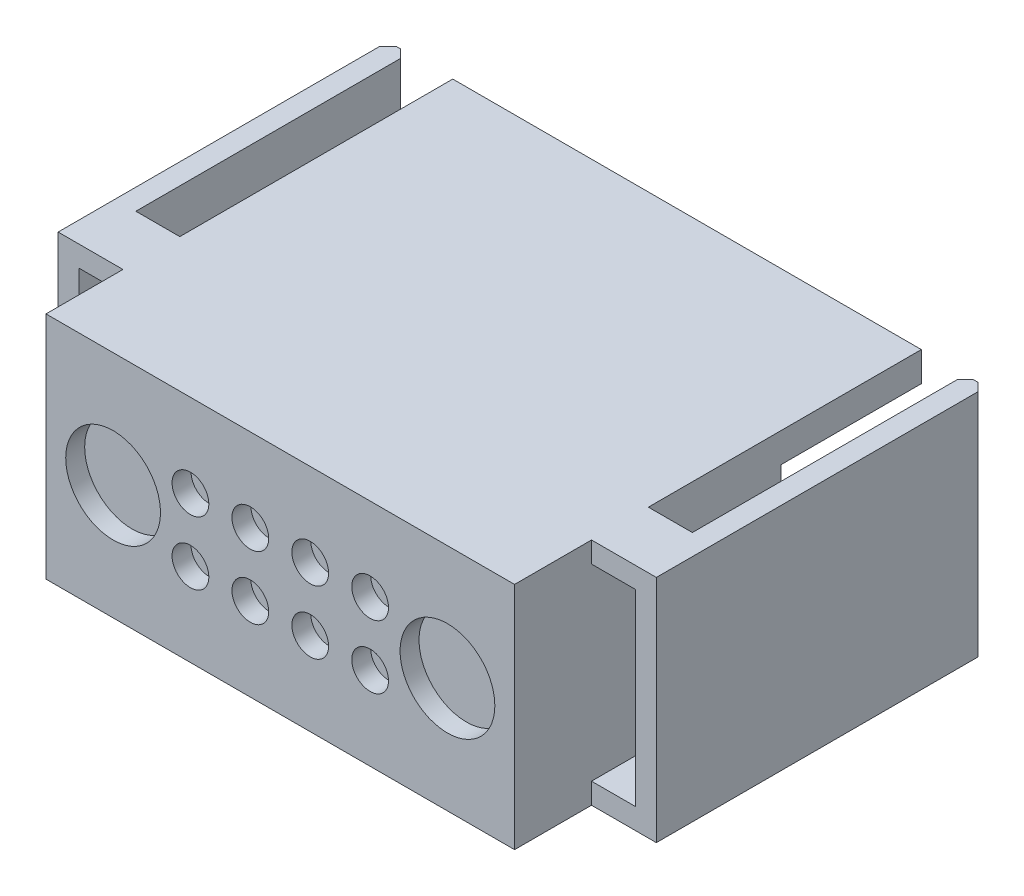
ISO-10303-21;
HEADER;
FILE_DESCRIPTION(('STEP AP214'),'2;1');
FILE_NAME('part.step','',(''),(''),'','','');
FILE_SCHEMA(('AUTOMOTIVE_DESIGN { 1 0 10303 214 1 1 1 1 }'));
ENDSEC;
DATA;
#1=APPLICATION_CONTEXT('core data for automotive mechanical design processes');
#2=APPLICATION_PROTOCOL_DEFINITION('international standard','automotive_design',2000,#1);
#3=PRODUCT_CONTEXT('',#1,'mechanical');
#4=PRODUCT('Part','Part','',(#3));
#5=PRODUCT_RELATED_PRODUCT_CATEGORY('part','',(#4));
#6=PRODUCT_DEFINITION_FORMATION('','',#4);
#7=PRODUCT_DEFINITION_CONTEXT('part definition',#1,'design');
#8=PRODUCT_DEFINITION('design','',#6,#7);
#9=PRODUCT_DEFINITION_SHAPE('','',#8);
#10=(LENGTH_UNIT() NAMED_UNIT(*) SI_UNIT(.MILLI.,.METRE.));
#11=(NAMED_UNIT(*) PLANE_ANGLE_UNIT() SI_UNIT($,.RADIAN.));
#12=(NAMED_UNIT(*) SI_UNIT($,.STERADIAN.) SOLID_ANGLE_UNIT());
#13=UNCERTAINTY_MEASURE_WITH_UNIT(LENGTH_MEASURE(1.E-05),#10,'distance_accuracy_value','');
#14=(GEOMETRIC_REPRESENTATION_CONTEXT(3) GLOBAL_UNCERTAINTY_ASSIGNED_CONTEXT((#13)) GLOBAL_UNIT_ASSIGNED_CONTEXT((#10,
#11,#12)) REPRESENTATION_CONTEXT('',''));
#15=CARTESIAN_POINT('',(0.,0.,0.));
#16=DIRECTION('',(0.,0.,1.));
#17=DIRECTION('',(1.,0.,0.));
#18=AXIS2_PLACEMENT_3D('',#15,#16,#17);
#19=CARTESIAN_POINT('',(-15.6972,7.6962,-17.8562));
#20=DIRECTION('',(0.,0.,1.));
#21=DIRECTION('',(1.,0.,0.));
#22=AXIS2_PLACEMENT_3D('',#19,#20,#21);
#23=PLANE('',#22);
#24=CARTESIAN_POINT('',(-6.01980000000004,-2.1209,-17.8562));
#25=DIRECTION('',(0.,0.,-1.));
#26=DIRECTION('',(-1.,0.,0.));
#27=AXIS2_PLACEMENT_3D('',#24,#25,#26);
#28=CIRCLE('',#27,1.2954);
#29=CARTESIAN_POINT('',(-7.31520000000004,-2.1209,-17.8562));
#30=VERTEX_POINT('',#29);
#31=EDGE_CURVE('E879',#30,#30,#28,.T.);
#32=ORIENTED_EDGE('',*,*,#31,.F.);
#33=EDGE_LOOP('',(#32));
#34=FACE_BOUND('',#33,.T.);
#35=CARTESIAN_POINT('',(-2.00660000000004,-2.1209,-17.8562));
#36=DIRECTION('',(0.,0.,-1.));
#37=DIRECTION('',(-1.,0.,0.));
#38=AXIS2_PLACEMENT_3D('',#35,#36,#37);
#39=CIRCLE('',#38,1.2954);
#40=CARTESIAN_POINT('',(-3.30200000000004,-2.1209,-17.8562));
#41=VERTEX_POINT('',#40);
#42=EDGE_CURVE('E871',#41,#41,#39,.T.);
#43=ORIENTED_EDGE('',*,*,#42,.F.);
#44=EDGE_LOOP('',(#43));
#45=FACE_BOUND('',#44,.T.);
#46=CARTESIAN_POINT('',(2.00659999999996,-2.1209,-17.8562));
#47=DIRECTION('',(0.,0.,-1.));
#48=DIRECTION('',(-1.,0.,0.));
#49=AXIS2_PLACEMENT_3D('',#46,#47,#48);
#50=CIRCLE('',#49,1.2954);
#51=CARTESIAN_POINT('',(0.711199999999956,-2.1209,-17.8562));
#52=VERTEX_POINT('',#51);
#53=EDGE_CURVE('E716',#52,#52,#50,.T.);
#54=ORIENTED_EDGE('',*,*,#53,.F.);
#55=EDGE_LOOP('',(#54));
#56=FACE_BOUND('',#55,.T.);
#57=CARTESIAN_POINT('',(6.01979999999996,-2.1209,-17.8562));
#58=DIRECTION('',(0.,0.,-1.));
#59=DIRECTION('',(-1.,0.,0.));
#60=AXIS2_PLACEMENT_3D('',#57,#58,#59);
#61=CIRCLE('',#60,1.2954);
#62=CARTESIAN_POINT('',(4.72439999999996,-2.1209,-17.8562));
#63=VERTEX_POINT('',#62);
#64=EDGE_CURVE('E703',#63,#63,#61,.T.);
#65=ORIENTED_EDGE('',*,*,#64,.F.);
#66=EDGE_LOOP('',(#65));
#67=FACE_BOUND('',#66,.T.);
#68=CARTESIAN_POINT('',(-6.0198,2.1209,-17.8562));
#69=DIRECTION('',(0.,0.,-1.));
#70=DIRECTION('',(-1.,0.,0.));
#71=AXIS2_PLACEMENT_3D('',#68,#69,#70);
#72=CIRCLE('',#71,1.2954);
#73=CARTESIAN_POINT('',(-7.3152,2.1209,-17.8562));
#74=VERTEX_POINT('',#73);
#75=EDGE_CURVE('E857',#74,#74,#72,.T.);
#76=ORIENTED_EDGE('',*,*,#75,.F.);
#77=EDGE_LOOP('',(#76));
#78=FACE_BOUND('',#77,.T.);
#79=CARTESIAN_POINT('',(-2.0066,2.1209,-17.8562));
#80=DIRECTION('',(0.,0.,-1.));
#81=DIRECTION('',(-1.,0.,0.));
#82=AXIS2_PLACEMENT_3D('',#79,#80,#81);
#83=CIRCLE('',#82,1.2954);
#84=CARTESIAN_POINT('',(-3.302,2.1209,-17.8562));
#85=VERTEX_POINT('',#84);
#86=EDGE_CURVE('E778',#85,#85,#83,.T.);
#87=ORIENTED_EDGE('',*,*,#86,.F.);
#88=EDGE_LOOP('',(#87));
#89=FACE_BOUND('',#88,.T.);
#90=CARTESIAN_POINT('',(2.0066,2.1209,-17.8562));
#91=DIRECTION('',(0.,0.,-1.));
#92=DIRECTION('',(-1.,0.,0.));
#93=AXIS2_PLACEMENT_3D('',#90,#91,#92);
#94=CIRCLE('',#93,1.2954);
#95=CARTESIAN_POINT('',(0.7112,2.1209,-17.8562));
#96=VERTEX_POINT('',#95);
#97=EDGE_CURVE('E737',#96,#96,#94,.T.);
#98=ORIENTED_EDGE('',*,*,#97,.F.);
#99=EDGE_LOOP('',(#98));
#100=FACE_BOUND('',#99,.T.);
#101=CARTESIAN_POINT('',(6.0198,2.1209,-17.8562));
#102=DIRECTION('',(0.,0.,-1.));
#103=DIRECTION('',(-1.,0.,0.));
#104=AXIS2_PLACEMENT_3D('',#101,#102,#103);
#105=CIRCLE('',#104,1.2954);
#106=CARTESIAN_POINT('',(4.7244,2.1209,-17.8562));
#107=VERTEX_POINT('',#106);
#108=EDGE_CURVE('E769',#107,#107,#105,.T.);
#109=ORIENTED_EDGE('',*,*,#108,.F.);
#110=EDGE_LOOP('',(#109));
#111=FACE_BOUND('',#110,.T.);
#112=CARTESIAN_POINT('',(11.2014,0.,-17.8562));
#113=DIRECTION('',(0.,0.,-1.));
#114=DIRECTION('',(1.,0.,0.));
#115=AXIS2_PLACEMENT_3D('',#112,#113,#114);
#116=CIRCLE('',#115,2.6416);
#117=CARTESIAN_POINT('',(13.843,0.,-17.8562));
#118=VERTEX_POINT('',#117);
#119=EDGE_CURVE('E783',#118,#118,#116,.T.);
#120=ORIENTED_EDGE('',*,*,#119,.F.);
#121=EDGE_LOOP('',(#120));
#122=FACE_BOUND('',#121,.T.);
#123=CARTESIAN_POINT('',(-11.2014,0.,-17.8562));
#124=DIRECTION('',(0.,0.,-1.));
#125=DIRECTION('',(-1.,0.,0.));
#126=AXIS2_PLACEMENT_3D('',#123,#124,#125);
#127=CIRCLE('',#126,2.6416);
#128=CARTESIAN_POINT('',(-13.843,0.,-17.8562));
#129=VERTEX_POINT('',#128);
#130=EDGE_CURVE('E313',#129,#129,#127,.T.);
#131=ORIENTED_EDGE('',*,*,#130,.F.);
#132=EDGE_LOOP('',(#131));
#133=FACE_BOUND('',#132,.T.);
#134=DIRECTION('',(0.707106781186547,-0.707106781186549,0.));
#135=VECTOR('',#134,1.);
#136=CARTESIAN_POINT('',(-13.9192,-5.715,-17.8562));
#137=LINE('',#136,#135);
#138=CARTESIAN_POINT('',(-15.6972,-3.937,-17.8562));
#139=VERTEX_POINT('',#138);
#140=CARTESIAN_POINT('',(-13.9192,-5.715,-17.8562));
#141=VERTEX_POINT('',#140);
#142=EDGE_CURVE('E360',#139,#141,#137,.T.);
#143=ORIENTED_EDGE('',*,*,#142,.F.);
#144=DIRECTION('',(0.,-1.,0.));
#145=VECTOR('',#144,1.);
#146=CARTESIAN_POINT('',(-15.6972,7.6962,-17.8562));
#147=LINE('',#146,#145);
#148=CARTESIAN_POINT('',(-15.6972,5.715,-17.8562));
#149=VERTEX_POINT('',#148);
#150=EDGE_CURVE('E632',#149,#139,#147,.T.);
#151=ORIENTED_EDGE('',*,*,#150,.F.);
#152=DIRECTION('',(-1.,0.,0.));
#153=VECTOR('',#152,1.);
#154=CARTESIAN_POINT('',(-15.6972,5.715,-17.8562));
#155=LINE('',#154,#153);
#156=CARTESIAN_POINT('',(-1.39699999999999,5.715,-17.8562));
#157=VERTEX_POINT('',#156);
#158=EDGE_CURVE('E417',#157,#149,#155,.T.);
#159=ORIENTED_EDGE('',*,*,#158,.F.);
#160=DIRECTION('',(-0.707106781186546,0.707106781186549,0.));
#161=VECTOR('',#160,1.);
#162=CARTESIAN_POINT('',(-1.39699999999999,5.715,-17.8562));
#163=LINE('',#162,#161);
#164=CARTESIAN_POINT('',(0.,4.318,-17.8562));
#165=VERTEX_POINT('',#164);
#166=EDGE_CURVE('E442',#165,#157,#163,.T.);
#167=ORIENTED_EDGE('',*,*,#166,.F.);
#168=DIRECTION('',(-0.707106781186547,-0.707106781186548,0.));
#169=VECTOR('',#168,1.);
#170=CARTESIAN_POINT('',(0.,4.318,-17.8562));
#171=LINE('',#170,#169);
#172=CARTESIAN_POINT('',(1.39699999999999,5.715,-17.8562));
#173=VERTEX_POINT('',#172);
#174=EDGE_CURVE('E439',#173,#165,#171,.T.);
#175=ORIENTED_EDGE('',*,*,#174,.F.);
#176=DIRECTION('',(-1.,0.,0.));
#177=VECTOR('',#176,1.);
#178=CARTESIAN_POINT('',(1.39699999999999,5.715,-17.8562));
#179=LINE('',#178,#177);
#180=CARTESIAN_POINT('',(15.6972,5.715,-17.8562));
#181=VERTEX_POINT('',#180);
#182=EDGE_CURVE('E411',#181,#173,#179,.T.);
#183=ORIENTED_EDGE('',*,*,#182,.F.);
#184=DIRECTION('',(0.,-1.,0.));
#185=VECTOR('',#184,1.);
#186=CARTESIAN_POINT('',(15.6972,7.6962,-17.8562));
#187=LINE('',#186,#185);
#188=CARTESIAN_POINT('',(15.6972,-3.937,-17.8562));
#189=VERTEX_POINT('',#188);
#190=EDGE_CURVE('E636',#181,#189,#187,.T.);
#191=ORIENTED_EDGE('',*,*,#190,.T.);
#192=DIRECTION('',(0.707106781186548,0.707106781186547,0.));
#193=VECTOR('',#192,1.);
#194=CARTESIAN_POINT('',(15.6972,-3.937,-17.8562));
#195=LINE('',#194,#193);
#196=CARTESIAN_POINT('',(13.9192,-5.715,-17.8562));
#197=VERTEX_POINT('',#196);
#198=EDGE_CURVE('E57',#197,#189,#195,.T.);
#199=ORIENTED_EDGE('',*,*,#198,.F.);
#200=DIRECTION('',(1.,0.,0.));
#201=VECTOR('',#200,1.);
#202=CARTESIAN_POINT('',(13.9192,-5.715,-17.8562));
#203=LINE('',#202,#201);
#204=EDGE_CURVE('E52',#141,#197,#203,.T.);
#205=ORIENTED_EDGE('',*,*,#204,.F.);
#206=EDGE_LOOP('',(#143,#151,#159,#167,#175,#183,#191,#199,#205));
#207=FACE_BOUND('',#206,.T.);
#208=ADVANCED_FACE('F36',(#34,#45,#56,#67,#78,#89,#100,#111,#122,#133,#207),#23,.F.);
#209=CARTESIAN_POINT('',(18.6436,7.6962,-8.9662));
#210=DIRECTION('',(0.,0.,1.));
#211=DIRECTION('',(1.,0.,0.));
#212=AXIS2_PLACEMENT_3D('',#209,#210,#211);
#213=PLANE('',#212);
#214=DIRECTION('',(0.,-1.,0.));
#215=VECTOR('',#214,1.);
#216=CARTESIAN_POINT('',(18.6436,7.6962,-8.9662));
#217=LINE('',#216,#215);
#218=CARTESIAN_POINT('',(18.6436,7.6962,-8.9662));
#219=VERTEX_POINT('',#218);
#220=CARTESIAN_POINT('',(18.6436,6.2992,-8.9662));
#221=VERTEX_POINT('',#220);
#222=EDGE_CURVE('E645',#219,#221,#217,.T.);
#223=ORIENTED_EDGE('',*,*,#222,.T.);
#224=DIRECTION('',(1.,0.,0.));
#225=VECTOR('',#224,1.);
#226=CARTESIAN_POINT('',(15.6972,6.2992,-8.9662));
#227=LINE('',#226,#225);
#228=CARTESIAN_POINT('',(15.6972,6.2992,-8.9662));
#229=VERTEX_POINT('',#228);
#230=EDGE_CURVE('E465',#229,#221,#227,.T.);
#231=ORIENTED_EDGE('',*,*,#230,.F.);
#232=DIRECTION('',(0.,-1.,0.));
#233=VECTOR('',#232,1.);
#234=CARTESIAN_POINT('',(15.6972,7.6962,-8.9662));
#235=LINE('',#234,#233);
#236=CARTESIAN_POINT('',(15.6972,7.6962,-8.9662));
#237=VERTEX_POINT('',#236);
#238=EDGE_CURVE('E640',#237,#229,#235,.T.);
#239=ORIENTED_EDGE('',*,*,#238,.F.);
#240=DIRECTION('',(-1.,0.,0.));
#241=VECTOR('',#240,1.);
#242=CARTESIAN_POINT('',(18.6436,7.6962,-8.9662));
#243=LINE('',#242,#241);
#244=EDGE_CURVE('E550',#219,#237,#243,.T.);
#245=ORIENTED_EDGE('',*,*,#244,.F.);
#246=EDGE_LOOP('',(#223,#231,#239,#245));
#247=FACE_BOUND('',#246,.T.);
#248=ADVANCED_FACE('F796',(#247),#213,.F.);
#249=CARTESIAN_POINT('',(-18.6436,7.6962,-8.9662));
#250=DIRECTION('',(0.,0.,1.));
#251=DIRECTION('',(1.,0.,0.));
#252=AXIS2_PLACEMENT_3D('',#249,#250,#251);
#253=PLANE('',#252);
#254=DIRECTION('',(0.,-1.,0.));
#255=VECTOR('',#254,1.);
#256=CARTESIAN_POINT('',(-15.6972,7.6962,-8.9662));
#257=LINE('',#256,#255);
#258=CARTESIAN_POINT('',(-15.6972,7.6962,-8.9662));
#259=VERTEX_POINT('',#258);
#260=CARTESIAN_POINT('',(-15.6972,6.2992,-8.9662));
#261=VERTEX_POINT('',#260);
#262=EDGE_CURVE('E628',#259,#261,#257,.T.);
#263=ORIENTED_EDGE('',*,*,#262,.T.);
#264=DIRECTION('',(1.,0.,0.));
#265=VECTOR('',#264,1.);
#266=CARTESIAN_POINT('',(-15.6972,6.2992,-8.9662));
#267=LINE('',#266,#265);
#268=CARTESIAN_POINT('',(-18.6436,6.2992,-8.9662));
#269=VERTEX_POINT('',#268);
#270=EDGE_CURVE('E503',#269,#261,#267,.T.);
#271=ORIENTED_EDGE('',*,*,#270,.F.);
#272=DIRECTION('',(0.,-1.,0.));
#273=VECTOR('',#272,1.);
#274=CARTESIAN_POINT('',(-18.6436,7.6962,-8.9662));
#275=LINE('',#274,#273);
#276=CARTESIAN_POINT('',(-18.6436,7.6962,-8.9662));
#277=VERTEX_POINT('',#276);
#278=EDGE_CURVE('E623',#277,#269,#275,.T.);
#279=ORIENTED_EDGE('',*,*,#278,.F.);
#280=DIRECTION('',(-1.,0.,0.));
#281=VECTOR('',#280,1.);
#282=CARTESIAN_POINT('',(-18.6436,7.6962,-8.9662));
#283=LINE('',#282,#281);
#284=EDGE_CURVE('E559',#259,#277,#283,.T.);
#285=ORIENTED_EDGE('',*,*,#284,.F.);
#286=EDGE_LOOP('',(#263,#271,#279,#285));
#287=FACE_BOUND('',#286,.T.);
#288=ADVANCED_FACE('F924',(#287),#253,.F.);
#289=CARTESIAN_POINT('',(15.6972,7.6962,0.));
#290=DIRECTION('',(0.,0.,-1.));
#291=DIRECTION('',(-1.,0.,0.));
#292=AXIS2_PLACEMENT_3D('',#289,#290,#291);
#293=PLANE('',#292);
#294=CARTESIAN_POINT('',(-6.01979999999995,-2.12090000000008,0.));
#295=DIRECTION('',(0.,0.,1.));
#296=DIRECTION('',(1.,0.,0.));
#297=AXIS2_PLACEMENT_3D('',#294,#295,#296);
#298=CIRCLE('',#297,1.2319);
#299=CARTESIAN_POINT('',(-4.78789999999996,-2.12090000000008,0.));
#300=VERTEX_POINT('',#299);
#301=EDGE_CURVE('E744',#300,#300,#298,.T.);
#302=ORIENTED_EDGE('',*,*,#301,.F.);
#303=EDGE_LOOP('',(#302));
#304=FACE_BOUND('',#303,.T.);
#305=CARTESIAN_POINT('',(-2.00659999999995,-2.12090000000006,0.));
#306=DIRECTION('',(0.,0.,1.));
#307=DIRECTION('',(1.,0.,0.));
#308=AXIS2_PLACEMENT_3D('',#305,#306,#307);
#309=CIRCLE('',#308,1.2319);
#310=CARTESIAN_POINT('',(-0.774699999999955,-2.12090000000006,0.));
#311=VERTEX_POINT('',#310);
#312=EDGE_CURVE('E731',#311,#311,#309,.T.);
#313=ORIENTED_EDGE('',*,*,#312,.F.);
#314=EDGE_LOOP('',(#313));
#315=FACE_BOUND('',#314,.T.);
#316=CARTESIAN_POINT('',(2.00660000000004,-2.12090000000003,0.));
#317=DIRECTION('',(0.,0.,1.));
#318=DIRECTION('',(1.,0.,0.));
#319=AXIS2_PLACEMENT_3D('',#316,#317,#318);
#320=CIRCLE('',#319,1.2319);
#321=CARTESIAN_POINT('',(3.23850000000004,-2.12090000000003,0.));
#322=VERTEX_POINT('',#321);
#323=EDGE_CURVE('E838',#322,#322,#320,.T.);
#324=ORIENTED_EDGE('',*,*,#323,.F.);
#325=EDGE_LOOP('',(#324));
#326=FACE_BOUND('',#325,.T.);
#327=CARTESIAN_POINT('',(6.01980000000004,-2.1209,0.));
#328=DIRECTION('',(0.,0.,1.));
#329=DIRECTION('',(1.,0.,0.));
#330=AXIS2_PLACEMENT_3D('',#327,#328,#329);
#331=CIRCLE('',#330,1.2319);
#332=CARTESIAN_POINT('',(7.25170000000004,-2.1209,0.));
#333=VERTEX_POINT('',#332);
#334=EDGE_CURVE('E725',#333,#333,#331,.T.);
#335=ORIENTED_EDGE('',*,*,#334,.F.);
#336=EDGE_LOOP('',(#335));
#337=FACE_BOUND('',#336,.T.);
#338=CARTESIAN_POINT('',(-6.0198,2.12089999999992,0.));
#339=DIRECTION('',(0.,0.,1.));
#340=DIRECTION('',(1.,0.,0.));
#341=AXIS2_PLACEMENT_3D('',#338,#339,#340);
#342=CIRCLE('',#341,1.2319);
#343=CARTESIAN_POINT('',(-4.7879,2.12089999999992,0.));
#344=VERTEX_POINT('',#343);
#345=EDGE_CURVE('E713',#344,#344,#342,.T.);
#346=ORIENTED_EDGE('',*,*,#345,.F.);
#347=EDGE_LOOP('',(#346));
#348=FACE_BOUND('',#347,.T.);
#349=CARTESIAN_POINT('',(-2.0066,2.12089999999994,0.));
#350=DIRECTION('',(0.,0.,1.));
#351=DIRECTION('',(1.,0.,0.));
#352=AXIS2_PLACEMENT_3D('',#349,#350,#351);
#353=CIRCLE('',#352,1.2319);
#354=CARTESIAN_POINT('',(-0.7747,2.12089999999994,0.));
#355=VERTEX_POINT('',#354);
#356=EDGE_CURVE('E712',#355,#355,#353,.T.);
#357=ORIENTED_EDGE('',*,*,#356,.F.);
#358=EDGE_LOOP('',(#357));
#359=FACE_BOUND('',#358,.T.);
#360=CARTESIAN_POINT('',(2.0066,2.12089999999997,0.));
#361=DIRECTION('',(0.,0.,1.));
#362=DIRECTION('',(1.,0.,0.));
#363=AXIS2_PLACEMENT_3D('',#360,#361,#362);
#364=CIRCLE('',#363,1.2319);
#365=CARTESIAN_POINT('',(3.2385,2.12089999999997,0.));
#366=VERTEX_POINT('',#365);
#367=EDGE_CURVE('E697',#366,#366,#364,.T.);
#368=ORIENTED_EDGE('',*,*,#367,.F.);
#369=EDGE_LOOP('',(#368));
#370=FACE_BOUND('',#369,.T.);
#371=CARTESIAN_POINT('',(6.0198,2.1209,0.));
#372=DIRECTION('',(0.,0.,1.));
#373=DIRECTION('',(1.,0.,0.));
#374=AXIS2_PLACEMENT_3D('',#371,#372,#373);
#375=CIRCLE('',#374,1.2319);
#376=CARTESIAN_POINT('',(7.2517,2.1209,0.));
#377=VERTEX_POINT('',#376);
#378=EDGE_CURVE('E848',#377,#377,#375,.T.);
#379=ORIENTED_EDGE('',*,*,#378,.F.);
#380=EDGE_LOOP('',(#379));
#381=FACE_BOUND('',#380,.T.);
#382=CARTESIAN_POINT('',(-11.2014,0.,0.));
#383=DIRECTION('',(0.,0.,1.));
#384=DIRECTION('',(-1.,0.,0.));
#385=AXIS2_PLACEMENT_3D('',#382,#383,#384);
#386=CIRCLE('',#385,3.175);
#387=CARTESIAN_POINT('',(-14.3764,0.,0.));
#388=VERTEX_POINT('',#387);
#389=EDGE_CURVE('E766',#388,#388,#386,.T.);
#390=ORIENTED_EDGE('',*,*,#389,.F.);
#391=EDGE_LOOP('',(#390));
#392=FACE_BOUND('',#391,.T.);
#393=CARTESIAN_POINT('',(11.2014,0.,0.));
#394=DIRECTION('',(0.,0.,1.));
#395=DIRECTION('',(1.,0.,0.));
#396=AXIS2_PLACEMENT_3D('',#393,#394,#395);
#397=CIRCLE('',#396,3.175);
#398=CARTESIAN_POINT('',(14.3764,0.,0.));
#399=VERTEX_POINT('',#398);
#400=EDGE_CURVE('E719',#399,#399,#397,.T.);
#401=ORIENTED_EDGE('',*,*,#400,.F.);
#402=EDGE_LOOP('',(#401));
#403=FACE_BOUND('',#402,.T.);
#404=DIRECTION('',(1.,0.,0.));
#405=VECTOR('',#404,1.);
#406=CARTESIAN_POINT('',(15.6972,-7.6962,0.));
#407=LINE('',#406,#405);
#408=CARTESIAN_POINT('',(-15.6972,-7.6962,0.));
#409=VERTEX_POINT('',#408);
#410=CARTESIAN_POINT('',(15.6972,-7.6962,0.));
#411=VERTEX_POINT('',#410);
#412=EDGE_CURVE('E575',#409,#411,#407,.T.);
#413=ORIENTED_EDGE('',*,*,#412,.T.);
#414=DIRECTION('',(0.,-1.,0.));
#415=VECTOR('',#414,1.);
#416=CARTESIAN_POINT('',(15.6972,7.6962,0.));
#417=LINE('',#416,#415);
#418=CARTESIAN_POINT('',(15.6972,7.6962,0.));
#419=VERTEX_POINT('',#418);
#420=EDGE_CURVE('E45',#419,#411,#417,.T.);
#421=ORIENTED_EDGE('',*,*,#420,.F.);
#422=DIRECTION('',(1.,0.,0.));
#423=VECTOR('',#422,1.);
#424=CARTESIAN_POINT('',(15.6972,7.6962,0.));
#425=LINE('',#424,#423);
#426=CARTESIAN_POINT('',(-15.6972,7.6962,0.));
#427=VERTEX_POINT('',#426);
#428=EDGE_CURVE('E534',#427,#419,#425,.T.);
#429=ORIENTED_EDGE('',*,*,#428,.F.);
#430=DIRECTION('',(0.,-1.,0.));
#431=VECTOR('',#430,1.);
#432=CARTESIAN_POINT('',(-15.6972,7.6962,0.));
#433=LINE('',#432,#431);
#434=EDGE_CURVE('E11',#427,#409,#433,.T.);
#435=ORIENTED_EDGE('',*,*,#434,.T.);
#436=EDGE_LOOP('',(#413,#421,#429,#435));
#437=FACE_BOUND('',#436,.T.);
#438=ADVANCED_FACE('F38',(#304,#315,#326,#337,#348,#359,#370,#381,#392,#403,#437),#293,.F.);
#439=CARTESIAN_POINT('',(15.6972,7.6962,-5.1562));
#440=DIRECTION('',(0.,0.,-1.));
#441=DIRECTION('',(-1.,0.,0.));
#442=AXIS2_PLACEMENT_3D('',#439,#440,#441);
#443=PLANE('',#442);
#444=DIRECTION('',(0.,-1.,0.));
#445=VECTOR('',#444,1.);
#446=CARTESIAN_POINT('',(15.6972,7.6962,-5.1562));
#447=LINE('',#446,#445);
#448=CARTESIAN_POINT('',(15.6972,7.6962,-5.1562));
#449=VERTEX_POINT('',#448);
#450=CARTESIAN_POINT('',(15.6972,6.2992,-5.1562));
#451=VERTEX_POINT('',#450);
#452=EDGE_CURVE('E654',#449,#451,#447,.T.);
#453=ORIENTED_EDGE('',*,*,#452,.T.);
#454=DIRECTION('',(1.,0.,0.));
#455=VECTOR('',#454,1.);
#456=CARTESIAN_POINT('',(15.6972,6.2992,-5.1562));
#457=LINE('',#456,#455);
#458=CARTESIAN_POINT('',(18.6436,6.2992,-5.1562));
#459=VERTEX_POINT('',#458);
#460=EDGE_CURVE('E466',#451,#459,#457,.T.);
#461=ORIENTED_EDGE('',*,*,#460,.T.);
#462=DIRECTION('',(0.,-1.,0.));
#463=VECTOR('',#462,1.);
#464=CARTESIAN_POINT('',(18.6436,-6.2992,-5.1562));
#465=LINE('',#464,#463);
#466=CARTESIAN_POINT('',(18.6436,-6.2992,-5.15619999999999));
#467=VERTEX_POINT('',#466);
#468=EDGE_CURVE('E470',#459,#467,#465,.T.);
#469=ORIENTED_EDGE('',*,*,#468,.T.);
#470=DIRECTION('',(-1.,0.,0.));
#471=VECTOR('',#470,1.);
#472=CARTESIAN_POINT('',(15.6972,-6.2992,-5.1562));
#473=LINE('',#472,#471);
#474=CARTESIAN_POINT('',(15.6972,-6.2992,-5.1562));
#475=VERTEX_POINT('',#474);
#476=EDGE_CURVE('E475',#467,#475,#473,.T.);
#477=ORIENTED_EDGE('',*,*,#476,.T.);
#478=CARTESIAN_POINT('',(15.6972,-7.6962,-5.1562));
#479=VERTEX_POINT('',#478);
#480=EDGE_CURVE('E653',#475,#479,#447,.T.);
#481=ORIENTED_EDGE('',*,*,#480,.T.);
#482=DIRECTION('',(1.,0.,0.));
#483=VECTOR('',#482,1.);
#484=CARTESIAN_POINT('',(15.6972,-7.6962,-5.1562));
#485=LINE('',#484,#483);
#486=CARTESIAN_POINT('',(20.0406,-7.6962,-5.15619999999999));
#487=VERTEX_POINT('',#486);
#488=EDGE_CURVE('E582',#479,#487,#485,.T.);
#489=ORIENTED_EDGE('',*,*,#488,.T.);
#490=DIRECTION('',(0.,-1.,0.));
#491=VECTOR('',#490,1.);
#492=CARTESIAN_POINT('',(20.0406,7.6962,-5.15619999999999));
#493=LINE('',#492,#491);
#494=CARTESIAN_POINT('',(20.0406,7.6962,-5.15619999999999));
#495=VERTEX_POINT('',#494);
#496=EDGE_CURVE('E649',#495,#487,#493,.T.);
#497=ORIENTED_EDGE('',*,*,#496,.F.);
#498=DIRECTION('',(1.,0.,0.));
#499=VECTOR('',#498,1.);
#500=CARTESIAN_POINT('',(15.6972,7.6962,-5.1562));
#501=LINE('',#500,#499);
#502=EDGE_CURVE('E541',#449,#495,#501,.T.);
#503=ORIENTED_EDGE('',*,*,#502,.F.);
#504=EDGE_LOOP('',(#453,#461,#469,#477,#481,#489,#497,#503));
#505=FACE_BOUND('',#504,.T.);
#506=ADVANCED_FACE('F672',(#505),#443,.F.);
#507=CARTESIAN_POINT('',(20.0406,7.6962,-5.15619999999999));
#508=DIRECTION('',(-1.,0.,0.));
#509=DIRECTION('',(0.,0.,1.));
#510=AXIS2_PLACEMENT_3D('',#507,#508,#509);
#511=PLANE('',#510);
#512=DIRECTION('',(0.,0.,-1.));
#513=VECTOR('',#512,1.);
#514=CARTESIAN_POINT('',(20.0406,-7.6962,-5.15619999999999));
#515=LINE('',#514,#513);
#516=CARTESIAN_POINT('',(20.0406,-7.6962,-26.7081));
#517=VERTEX_POINT('',#516);
#518=EDGE_CURVE('E585',#487,#517,#515,.T.);
#519=ORIENTED_EDGE('',*,*,#518,.T.);
#520=DIRECTION('',(0.,1.,0.));
#521=VECTOR('',#520,1.);
#522=CARTESIAN_POINT('',(20.0406,-7.6962,-26.7081));
#523=LINE('',#522,#521);
#524=CARTESIAN_POINT('',(20.0406,7.6962,-26.7081));
#525=VERTEX_POINT('',#524);
#526=EDGE_CURVE('E327',#517,#525,#523,.T.);
#527=ORIENTED_EDGE('',*,*,#526,.T.);
#528=DIRECTION('',(0.,0.,-1.));
#529=VECTOR('',#528,1.);
#530=CARTESIAN_POINT('',(20.0406,7.6962,-5.15619999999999));
#531=LINE('',#530,#529);
#532=EDGE_CURVE('E544',#495,#525,#531,.T.);
#533=ORIENTED_EDGE('',*,*,#532,.F.);
#534=ORIENTED_EDGE('',*,*,#496,.T.);
#535=EDGE_LOOP('',(#519,#527,#533,#534));
#536=FACE_BOUND('',#535,.T.);
#537=ADVANCED_FACE('F676',(#536),#511,.F.);
#538=CARTESIAN_POINT('',(18.6436,7.6962,-17.8562));
#539=DIRECTION('',(1.,0.,0.));
#540=DIRECTION('',(0.,0.,-1.));
#541=AXIS2_PLACEMENT_3D('',#538,#539,#540);
#542=PLANE('',#541);
#543=DIRECTION('',(0.,0.,1.));
#544=VECTOR('',#543,1.);
#545=CARTESIAN_POINT('',(18.6436,-7.6962,-17.8562));
#546=LINE('',#545,#544);
#547=CARTESIAN_POINT('',(18.6436,-7.6962,-26.7081000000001));
#548=VERTEX_POINT('',#547);
#549=CARTESIAN_POINT('',(18.6436,-7.6962,-8.9662));
#550=VERTEX_POINT('',#549);
#551=EDGE_CURVE('E298',#548,#550,#546,.T.);
#552=ORIENTED_EDGE('',*,*,#551,.T.);
#553=CARTESIAN_POINT('',(18.6436,-6.2992,-8.9662));
#554=VERTEX_POINT('',#553);
#555=EDGE_CURVE('E644',#554,#550,#217,.T.);
#556=ORIENTED_EDGE('',*,*,#555,.F.);
#557=DIRECTION('',(0.,0.,-1.));
#558=VECTOR('',#557,1.);
#559=CARTESIAN_POINT('',(18.6436,-6.2992,-5.1562));
#560=LINE('',#559,#558);
#561=EDGE_CURVE('E493',#467,#554,#560,.T.);
#562=ORIENTED_EDGE('',*,*,#561,.F.);
#563=ORIENTED_EDGE('',*,*,#468,.F.);
#564=DIRECTION('',(0.,0.,-1.));
#565=VECTOR('',#564,1.);
#566=CARTESIAN_POINT('',(18.6436,6.2992,-5.1562));
#567=LINE('',#566,#565);
#568=EDGE_CURVE('E479',#459,#221,#567,.T.);
#569=ORIENTED_EDGE('',*,*,#568,.T.);
#570=ORIENTED_EDGE('',*,*,#222,.F.);
#571=DIRECTION('',(0.,0.,1.));
#572=VECTOR('',#571,1.);
#573=CARTESIAN_POINT('',(18.6436,7.6962,-17.8562));
#574=LINE('',#573,#572);
#575=CARTESIAN_POINT('',(18.6436,7.6962,-26.7081000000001));
#576=VERTEX_POINT('',#575);
#577=EDGE_CURVE('E547',#576,#219,#574,.T.);
#578=ORIENTED_EDGE('',*,*,#577,.F.);
#579=DIRECTION('',(0.,1.,0.));
#580=VECTOR('',#579,1.);
#581=CARTESIAN_POINT('',(18.6436,-7.6962,-26.7081000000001));
#582=LINE('',#581,#580);
#583=EDGE_CURVE('E286',#548,#576,#582,.T.);
#584=ORIENTED_EDGE('',*,*,#583,.F.);
#585=EDGE_LOOP('',(#552,#556,#562,#563,#569,#570,#578,#584));
#586=FACE_BOUND('',#585,.T.);
#587=ADVANCED_FACE('F691',(#586),#542,.F.);
#588=CARTESIAN_POINT('',(15.6972,-6.2992,-8.9662));
#589=VERTEX_POINT('',#588);
#590=CARTESIAN_POINT('',(15.6972,-7.6962,-8.9662));
#591=VERTEX_POINT('',#590);
#592=EDGE_CURVE('E639',#589,#591,#235,.T.);
#593=ORIENTED_EDGE('',*,*,#592,.F.);
#594=DIRECTION('',(-1.,0.,0.));
#595=VECTOR('',#594,1.);
#596=CARTESIAN_POINT('',(15.6972,-6.2992,-8.9662));
#597=LINE('',#596,#595);
#598=EDGE_CURVE('E471',#554,#589,#597,.T.);
#599=ORIENTED_EDGE('',*,*,#598,.F.);
#600=ORIENTED_EDGE('',*,*,#555,.T.);
#601=DIRECTION('',(-1.,0.,0.));
#602=VECTOR('',#601,1.);
#603=CARTESIAN_POINT('',(18.6436,-7.6962,-8.9662));
#604=LINE('',#603,#602);
#605=EDGE_CURVE('E590',#550,#591,#604,.T.);
#606=ORIENTED_EDGE('',*,*,#605,.T.);
#607=EDGE_LOOP('',(#593,#599,#600,#606));
#608=FACE_BOUND('',#607,.T.);
#609=ADVANCED_FACE('F753',(#608),#213,.F.);
#610=CARTESIAN_POINT('',(15.6972,7.6962,-8.9662));
#611=DIRECTION('',(-1.,0.,0.));
#612=DIRECTION('',(0.,0.,1.));
#613=AXIS2_PLACEMENT_3D('',#610,#611,#612);
#614=PLANE('',#613);
#615=DIRECTION('',(0.,0.,-1.));
#616=VECTOR('',#615,1.);
#617=CARTESIAN_POINT('',(15.6972,-7.6962,-8.9662));
#618=LINE('',#617,#616);
#619=CARTESIAN_POINT('',(15.6972,-7.6962,-27.2542));
#620=VERTEX_POINT('',#619);
#621=EDGE_CURVE('E594',#591,#620,#618,.T.);
#622=ORIENTED_EDGE('',*,*,#621,.T.);
#623=DIRECTION('',(0.,-1.,0.));
#624=VECTOR('',#623,1.);
#625=CARTESIAN_POINT('',(15.6972,-3.937,-27.2542));
#626=LINE('',#625,#624);
#627=CARTESIAN_POINT('',(15.6972,-3.937,-27.2542));
#628=VERTEX_POINT('',#627);
#629=EDGE_CURVE('E370',#628,#620,#626,.T.);
#630=ORIENTED_EDGE('',*,*,#629,.F.);
#631=DIRECTION('',(0.,0.,1.));
#632=VECTOR('',#631,1.);
#633=CARTESIAN_POINT('',(15.6972,-3.937,-27.2542));
#634=LINE('',#633,#632);
#635=EDGE_CURVE('E389',#628,#189,#634,.T.);
#636=ORIENTED_EDGE('',*,*,#635,.T.);
#637=ORIENTED_EDGE('',*,*,#190,.F.);
#638=DIRECTION('',(0.,0.,1.));
#639=VECTOR('',#638,1.);
#640=CARTESIAN_POINT('',(15.6972,5.715,-27.2542));
#641=LINE('',#640,#639);
#642=CARTESIAN_POINT('',(15.6972,5.715,-27.2542));
#643=VERTEX_POINT('',#642);
#644=EDGE_CURVE('E462',#643,#181,#641,.T.);
#645=ORIENTED_EDGE('',*,*,#644,.F.);
#646=DIRECTION('',(0.,-1.,0.));
#647=VECTOR('',#646,1.);
#648=CARTESIAN_POINT('',(15.6972,7.6962,-27.2542));
#649=LINE('',#648,#647);
#650=CARTESIAN_POINT('',(15.6972,7.6962,-27.2542));
#651=VERTEX_POINT('',#650);
#652=EDGE_CURVE('E421',#651,#643,#649,.T.);
#653=ORIENTED_EDGE('',*,*,#652,.F.);
#654=DIRECTION('',(0.,0.,-1.));
#655=VECTOR('',#654,1.);
#656=CARTESIAN_POINT('',(15.6972,7.6962,-8.9662));
#657=LINE('',#656,#655);
#658=EDGE_CURVE('E553',#237,#651,#657,.T.);
#659=ORIENTED_EDGE('',*,*,#658,.F.);
#660=ORIENTED_EDGE('',*,*,#238,.T.);
#661=DIRECTION('',(0.,0.,-1.));
#662=VECTOR('',#661,1.);
#663=CARTESIAN_POINT('',(15.6972,6.2992,-5.1562));
#664=LINE('',#663,#662);
#665=EDGE_CURVE('E485',#451,#229,#664,.T.);
#666=ORIENTED_EDGE('',*,*,#665,.F.);
#667=ORIENTED_EDGE('',*,*,#452,.F.);
#668=DIRECTION('',(0.,0.,-1.));
#669=VECTOR('',#668,1.);
#670=CARTESIAN_POINT('',(15.6972,7.6962,0.));
#671=LINE('',#670,#669);
#672=EDGE_CURVE('E538',#419,#449,#671,.T.);
#673=ORIENTED_EDGE('',*,*,#672,.F.);
#674=ORIENTED_EDGE('',*,*,#420,.T.);
#675=DIRECTION('',(0.,0.,-1.));
#676=VECTOR('',#675,1.);
#677=CARTESIAN_POINT('',(15.6972,-7.6962,0.));
#678=LINE('',#677,#676);
#679=EDGE_CURVE('E578',#411,#479,#678,.T.);
#680=ORIENTED_EDGE('',*,*,#679,.T.);
#681=ORIENTED_EDGE('',*,*,#480,.F.);
#682=DIRECTION('',(0.,0.,-1.));
#683=VECTOR('',#682,1.);
#684=CARTESIAN_POINT('',(15.6972,-6.2992,-5.1562));
#685=LINE('',#684,#683);
#686=EDGE_CURVE('E489',#475,#589,#685,.T.);
#687=ORIENTED_EDGE('',*,*,#686,.T.);
#688=ORIENTED_EDGE('',*,*,#592,.T.);
#689=EDGE_LOOP('',(#622,#630,#636,#637,#645,#653,#659,#660,#666,#667,#673,#674,#680,#681,#687,#688));
#690=FACE_BOUND('',#689,.T.);
#691=ADVANCED_FACE('F664',(#690),#614,.F.);
#692=CARTESIAN_POINT('',(-15.6972,7.6962,-8.9662));
#693=DIRECTION('',(1.,0.,0.));
#694=DIRECTION('',(0.,0.,-1.));
#695=AXIS2_PLACEMENT_3D('',#692,#693,#694);
#696=PLANE('',#695);
#697=DIRECTION('',(0.,0.,1.));
#698=VECTOR('',#697,1.);
#699=CARTESIAN_POINT('',(-15.6972,-7.6962,-8.9662));
#700=LINE('',#699,#698);
#701=CARTESIAN_POINT('',(-15.6972,-7.6962,-27.2542));
#702=VERTEX_POINT('',#701);
#703=CARTESIAN_POINT('',(-15.6972,-7.6962,-8.9662));
#704=VERTEX_POINT('',#703);
#705=EDGE_CURVE('E597',#702,#704,#700,.T.);
#706=ORIENTED_EDGE('',*,*,#705,.T.);
#707=CARTESIAN_POINT('',(-15.6972,-6.2992,-8.9662));
#708=VERTEX_POINT('',#707);
#709=EDGE_CURVE('E627',#708,#704,#257,.T.);
#710=ORIENTED_EDGE('',*,*,#709,.F.);
#711=DIRECTION('',(0.,0.,-1.));
#712=VECTOR('',#711,1.);
#713=CARTESIAN_POINT('',(-15.6972,-6.2992,-5.1562));
#714=LINE('',#713,#712);
#715=CARTESIAN_POINT('',(-15.6972,-6.2992,-5.1562));
#716=VERTEX_POINT('',#715);
#717=EDGE_CURVE('E511',#716,#708,#714,.T.);
#718=ORIENTED_EDGE('',*,*,#717,.F.);
#719=DIRECTION('',(0.,-1.,0.));
#720=VECTOR('',#719,1.);
#721=CARTESIAN_POINT('',(-15.6972,7.6962,-5.1562));
#722=LINE('',#721,#720);
#723=CARTESIAN_POINT('',(-15.6972,-7.6962,-5.1562));
#724=VERTEX_POINT('',#723);
#725=EDGE_CURVE('E571',#716,#724,#722,.T.);
#726=ORIENTED_EDGE('',*,*,#725,.T.);
#727=DIRECTION('',(0.,0.,1.));
#728=VECTOR('',#727,1.);
#729=CARTESIAN_POINT('',(-15.6972,-7.6962,0.));
#730=LINE('',#729,#728);
#731=EDGE_CURVE('E520',#724,#409,#730,.T.);
#732=ORIENTED_EDGE('',*,*,#731,.T.);
#733=ORIENTED_EDGE('',*,*,#434,.F.);
#734=DIRECTION('',(0.,0.,1.));
#735=VECTOR('',#734,1.);
#736=CARTESIAN_POINT('',(-15.6972,7.6962,0.));
#737=LINE('',#736,#735);
#738=CARTESIAN_POINT('',(-15.6972,7.6962,-5.1562));
#739=VERTEX_POINT('',#738);
#740=EDGE_CURVE('E530',#739,#427,#737,.T.);
#741=ORIENTED_EDGE('',*,*,#740,.F.);
#742=CARTESIAN_POINT('',(-15.6972,6.2992,-5.1562));
#743=VERTEX_POINT('',#742);
#744=EDGE_CURVE('E614',#739,#743,#722,.T.);
#745=ORIENTED_EDGE('',*,*,#744,.T.);
#746=DIRECTION('',(0.,0.,-1.));
#747=VECTOR('',#746,1.);
#748=CARTESIAN_POINT('',(-15.6972,6.2992,-5.1562));
#749=LINE('',#748,#747);
#750=EDGE_CURVE('E517',#743,#261,#749,.T.);
#751=ORIENTED_EDGE('',*,*,#750,.T.);
#752=ORIENTED_EDGE('',*,*,#262,.F.);
#753=DIRECTION('',(0.,0.,1.));
#754=VECTOR('',#753,1.);
#755=CARTESIAN_POINT('',(-15.6972,7.6962,-8.9662));
#756=LINE('',#755,#754);
#757=CARTESIAN_POINT('',(-15.6972,7.6962,-27.2542));
#758=VERTEX_POINT('',#757);
#759=EDGE_CURVE('E556',#758,#259,#756,.T.);
#760=ORIENTED_EDGE('',*,*,#759,.F.);
#761=DIRECTION('',(0.,1.,0.));
#762=VECTOR('',#761,1.);
#763=CARTESIAN_POINT('',(-15.6972,7.6962,-27.2542));
#764=LINE('',#763,#762);
#765=CARTESIAN_POINT('',(-15.6972,5.715,-27.2542));
#766=VERTEX_POINT('',#765);
#767=EDGE_CURVE('E412',#766,#758,#764,.T.);
#768=ORIENTED_EDGE('',*,*,#767,.F.);
#769=DIRECTION('',(0.,0.,1.));
#770=VECTOR('',#769,1.);
#771=CARTESIAN_POINT('',(-15.6972,5.715,-27.2542));
#772=LINE('',#771,#770);
#773=EDGE_CURVE('E436',#766,#149,#772,.T.);
#774=ORIENTED_EDGE('',*,*,#773,.T.);
#775=ORIENTED_EDGE('',*,*,#150,.T.);
#776=DIRECTION('',(0.,0.,1.));
#777=VECTOR('',#776,1.);
#778=CARTESIAN_POINT('',(-15.6972,-3.937,-27.2542));
#779=LINE('',#778,#777);
#780=CARTESIAN_POINT('',(-15.6972,-3.937,-27.2542));
#781=VERTEX_POINT('',#780);
#782=EDGE_CURVE('E407',#781,#139,#779,.T.);
#783=ORIENTED_EDGE('',*,*,#782,.F.);
#784=DIRECTION('',(0.,1.,0.));
#785=VECTOR('',#784,1.);
#786=CARTESIAN_POINT('',(-15.6972,-3.937,-27.2542));
#787=LINE('',#786,#785);
#788=EDGE_CURVE('E378',#702,#781,#787,.T.);
#789=ORIENTED_EDGE('',*,*,#788,.F.);
#790=EDGE_LOOP('',(#706,#710,#718,#726,#732,#733,#741,#745,#751,#752,#760,#768,#774,#775,#783,#789));
#791=FACE_BOUND('',#790,.T.);
#792=ADVANCED_FACE('F806',(#791),#696,.F.);
#793=CARTESIAN_POINT('',(-18.6436,-6.2992,-8.9662));
#794=VERTEX_POINT('',#793);
#795=CARTESIAN_POINT('',(-18.6436,-7.6962,-8.9662));
#796=VERTEX_POINT('',#795);
#797=EDGE_CURVE('E622',#794,#796,#275,.T.);
#798=ORIENTED_EDGE('',*,*,#797,.F.);
#799=DIRECTION('',(-1.,0.,0.));
#800=VECTOR('',#799,1.);
#801=CARTESIAN_POINT('',(-15.6972,-6.2992,-8.9662));
#802=LINE('',#801,#800);
#803=EDGE_CURVE('E488',#708,#794,#802,.T.);
#804=ORIENTED_EDGE('',*,*,#803,.F.);
#805=ORIENTED_EDGE('',*,*,#709,.T.);
#806=DIRECTION('',(-1.,0.,0.));
#807=VECTOR('',#806,1.);
#808=CARTESIAN_POINT('',(-18.6436,-7.6962,-8.9662));
#809=LINE('',#808,#807);
#810=EDGE_CURVE('E601',#704,#796,#809,.T.);
#811=ORIENTED_EDGE('',*,*,#810,.T.);
#812=EDGE_LOOP('',(#798,#804,#805,#811));
#813=FACE_BOUND('',#812,.T.);
#814=ADVANCED_FACE('F822',(#813),#253,.F.);
#815=CARTESIAN_POINT('',(-18.6436,7.6962,-17.8562));
#816=DIRECTION('',(-1.,0.,0.));
#817=DIRECTION('',(0.,0.,1.));
#818=AXIS2_PLACEMENT_3D('',#815,#816,#817);
#819=PLANE('',#818);
#820=DIRECTION('',(0.,0.,-1.));
#821=VECTOR('',#820,1.);
#822=CARTESIAN_POINT('',(-18.6436,-7.6962,-17.8562));
#823=LINE('',#822,#821);
#824=CARTESIAN_POINT('',(-18.6436,-7.6962,-26.7081000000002));
#825=VERTEX_POINT('',#824);
#826=EDGE_CURVE('E605',#796,#825,#823,.T.);
#827=ORIENTED_EDGE('',*,*,#826,.T.);
#828=DIRECTION('',(0.,1.,0.));
#829=VECTOR('',#828,1.);
#830=CARTESIAN_POINT('',(-18.6436,-7.6962,-26.7081000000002));
#831=LINE('',#830,#829);
#832=CARTESIAN_POINT('',(-18.6436,7.6962,-26.7081000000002));
#833=VERTEX_POINT('',#832);
#834=EDGE_CURVE('E346',#825,#833,#831,.T.);
#835=ORIENTED_EDGE('',*,*,#834,.T.);
#836=DIRECTION('',(0.,0.,-1.));
#837=VECTOR('',#836,1.);
#838=CARTESIAN_POINT('',(-18.6436,7.6962,-17.8562));
#839=LINE('',#838,#837);
#840=EDGE_CURVE('E562',#277,#833,#839,.T.);
#841=ORIENTED_EDGE('',*,*,#840,.F.);
#842=ORIENTED_EDGE('',*,*,#278,.T.);
#843=DIRECTION('',(0.,0.,-1.));
#844=VECTOR('',#843,1.);
#845=CARTESIAN_POINT('',(-18.6436,6.2992,-5.1562));
#846=LINE('',#845,#844);
#847=CARTESIAN_POINT('',(-18.6436,6.2992,-5.1562));
#848=VERTEX_POINT('',#847);
#849=EDGE_CURVE('E521',#848,#269,#846,.T.);
#850=ORIENTED_EDGE('',*,*,#849,.F.);
#851=DIRECTION('',(0.,1.,0.));
#852=VECTOR('',#851,1.);
#853=CARTESIAN_POINT('',(-18.6436,-6.2992,-5.1562));
#854=LINE('',#853,#852);
#855=CARTESIAN_POINT('',(-18.6436,-6.2992,-5.1562));
#856=VERTEX_POINT('',#855);
#857=EDGE_CURVE('E502',#856,#848,#854,.T.);
#858=ORIENTED_EDGE('',*,*,#857,.F.);
#859=DIRECTION('',(0.,0.,-1.));
#860=VECTOR('',#859,1.);
#861=CARTESIAN_POINT('',(-18.6436,-6.2992,-5.1562));
#862=LINE('',#861,#860);
#863=EDGE_CURVE('E524',#856,#794,#862,.T.);
#864=ORIENTED_EDGE('',*,*,#863,.T.);
#865=ORIENTED_EDGE('',*,*,#797,.T.);
#866=EDGE_LOOP('',(#827,#835,#841,#842,#850,#858,#864,#865));
#867=FACE_BOUND('',#866,.T.);
#868=ADVANCED_FACE('F829',(#867),#819,.F.);
#869=CARTESIAN_POINT('',(-20.0406,7.6962,-5.1562));
#870=DIRECTION('',(1.,0.,0.));
#871=DIRECTION('',(0.,0.,-1.));
#872=AXIS2_PLACEMENT_3D('',#869,#870,#871);
#873=PLANE('',#872);
#874=DIRECTION('',(0.,0.,1.));
#875=VECTOR('',#874,1.);
#876=CARTESIAN_POINT('',(-20.0406,-7.6962,-5.1562));
#877=LINE('',#876,#875);
#878=CARTESIAN_POINT('',(-20.0406,-7.6962,-26.7081));
#879=VERTEX_POINT('',#878);
#880=CARTESIAN_POINT('',(-20.0406,-7.6962,-5.1562));
#881=VERTEX_POINT('',#880);
#882=EDGE_CURVE('E608',#879,#881,#877,.T.);
#883=ORIENTED_EDGE('',*,*,#882,.T.);
#884=DIRECTION('',(0.,-1.,0.));
#885=VECTOR('',#884,1.);
#886=CARTESIAN_POINT('',(-20.0406,7.6962,-5.1562));
#887=LINE('',#886,#885);
#888=CARTESIAN_POINT('',(-20.0406,7.6962,-5.1562));
#889=VERTEX_POINT('',#888);
#890=EDGE_CURVE('E618',#889,#881,#887,.T.);
#891=ORIENTED_EDGE('',*,*,#890,.F.);
#892=DIRECTION('',(0.,0.,1.));
#893=VECTOR('',#892,1.);
#894=CARTESIAN_POINT('',(-20.0406,7.6962,-5.1562));
#895=LINE('',#894,#893);
#896=CARTESIAN_POINT('',(-20.0406,7.6962,-26.7081));
#897=VERTEX_POINT('',#896);
#898=EDGE_CURVE('E565',#897,#889,#895,.T.);
#899=ORIENTED_EDGE('',*,*,#898,.F.);
#900=DIRECTION('',(0.,1.,0.));
#901=VECTOR('',#900,1.);
#902=CARTESIAN_POINT('',(-20.0406,-7.6962,-26.7081));
#903=LINE('',#902,#901);
#904=EDGE_CURVE('E356',#879,#897,#903,.T.);
#905=ORIENTED_EDGE('',*,*,#904,.F.);
#906=EDGE_LOOP('',(#883,#891,#899,#905));
#907=FACE_BOUND('',#906,.T.);
#908=ADVANCED_FACE('F948',(#907),#873,.F.);
#909=CARTESIAN_POINT('',(-15.6972,7.6962,-5.1562));
#910=DIRECTION('',(0.,0.,-1.));
#911=DIRECTION('',(-1.,0.,0.));
#912=AXIS2_PLACEMENT_3D('',#909,#910,#911);
#913=PLANE('',#912);
#914=ORIENTED_EDGE('',*,*,#857,.T.);
#915=DIRECTION('',(1.,0.,0.));
#916=VECTOR('',#915,1.);
#917=CARTESIAN_POINT('',(-15.6972,6.2992,-5.1562));
#918=LINE('',#917,#916);
#919=EDGE_CURVE('E507',#848,#743,#918,.T.);
#920=ORIENTED_EDGE('',*,*,#919,.T.);
#921=ORIENTED_EDGE('',*,*,#744,.F.);
#922=DIRECTION('',(1.,0.,0.));
#923=VECTOR('',#922,1.);
#924=CARTESIAN_POINT('',(-15.6972,7.6962,-5.1562));
#925=LINE('',#924,#923);
#926=EDGE_CURVE('E568',#889,#739,#925,.T.);
#927=ORIENTED_EDGE('',*,*,#926,.F.);
#928=ORIENTED_EDGE('',*,*,#890,.T.);
#929=DIRECTION('',(1.,0.,0.));
#930=VECTOR('',#929,1.);
#931=CARTESIAN_POINT('',(-15.6972,-7.6962,-5.1562));
#932=LINE('',#931,#930);
#933=EDGE_CURVE('E535',#881,#724,#932,.T.);
#934=ORIENTED_EDGE('',*,*,#933,.T.);
#935=ORIENTED_EDGE('',*,*,#725,.F.);
#936=DIRECTION('',(-1.,0.,0.));
#937=VECTOR('',#936,1.);
#938=CARTESIAN_POINT('',(-15.6972,-6.2992,-5.1562));
#939=LINE('',#938,#937);
#940=EDGE_CURVE('E498',#716,#856,#939,.T.);
#941=ORIENTED_EDGE('',*,*,#940,.T.);
#942=EDGE_LOOP('',(#914,#920,#921,#927,#928,#934,#935,#941));
#943=FACE_BOUND('',#942,.T.);
#944=ADVANCED_FACE('F832',(#943),#913,.F.);
#945=CARTESIAN_POINT('',(-15.6972,7.6962,-8.9662));
#946=DIRECTION('',(0.,-1.,0.));
#947=DIRECTION('',(0.,0.,-1.));
#948=AXIS2_PLACEMENT_3D('',#945,#946,#947);
#949=PLANE('',#948);
#950=ORIENTED_EDGE('',*,*,#740,.T.);
#951=ORIENTED_EDGE('',*,*,#428,.T.);
#952=ORIENTED_EDGE('',*,*,#672,.T.);
#953=ORIENTED_EDGE('',*,*,#502,.T.);
#954=ORIENTED_EDGE('',*,*,#532,.T.);
#955=DIRECTION('',(-0.707106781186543,0.,-0.707106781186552));
#956=VECTOR('',#955,1.);
#957=CARTESIAN_POINT('',(19.4944999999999,7.6962,-27.2542000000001));
#958=LINE('',#957,#956);
#959=CARTESIAN_POINT('',(19.4944999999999,7.6962,-27.2542000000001));
#960=VERTEX_POINT('',#959);
#961=EDGE_CURVE('E305',#525,#960,#958,.T.);
#962=ORIENTED_EDGE('',*,*,#961,.T.);
#963=DIRECTION('',(-1.,0.,0.));
#964=VECTOR('',#963,1.);
#965=CARTESIAN_POINT('',(19.1896999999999,7.6962,-27.2542000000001));
#966=LINE('',#965,#964);
#967=CARTESIAN_POINT('',(19.1896999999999,7.6962,-27.2542000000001));
#968=VERTEX_POINT('',#967);
#969=EDGE_CURVE('E318',#960,#968,#966,.T.);
#970=ORIENTED_EDGE('',*,*,#969,.T.);
#971=DIRECTION('',(-0.707106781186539,0.,0.707106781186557));
#972=VECTOR('',#971,1.);
#973=CARTESIAN_POINT('',(19.1896999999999,7.6962,-27.2542000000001));
#974=LINE('',#973,#972);
#975=EDGE_CURVE('E280',#968,#576,#974,.T.);
#976=ORIENTED_EDGE('',*,*,#975,.T.);
#977=ORIENTED_EDGE('',*,*,#577,.T.);
#978=ORIENTED_EDGE('',*,*,#244,.T.);
#979=ORIENTED_EDGE('',*,*,#658,.T.);
#980=DIRECTION('',(1.,0.,0.));
#981=VECTOR('',#980,1.);
#982=CARTESIAN_POINT('',(15.6972,7.6962,-27.2542));
#983=LINE('',#982,#981);
#984=EDGE_CURVE('E416',#758,#651,#983,.T.);
#985=ORIENTED_EDGE('',*,*,#984,.F.);
#986=ORIENTED_EDGE('',*,*,#759,.T.);
#987=ORIENTED_EDGE('',*,*,#284,.T.);
#988=ORIENTED_EDGE('',*,*,#840,.T.);
#989=DIRECTION('',(-0.707106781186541,0.,-0.707106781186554));
#990=VECTOR('',#989,1.);
#991=CARTESIAN_POINT('',(-19.1896999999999,7.6962,-27.2542000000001));
#992=LINE('',#991,#990);
#993=CARTESIAN_POINT('',(-19.1896999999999,7.6962,-27.2542000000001));
#994=VERTEX_POINT('',#993);
#995=EDGE_CURVE('E326',#833,#994,#992,.T.);
#996=ORIENTED_EDGE('',*,*,#995,.T.);
#997=DIRECTION('',(-1.,0.,0.));
#998=VECTOR('',#997,1.);
#999=CARTESIAN_POINT('',(-19.1896999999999,7.6962,-27.2542000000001));
#1000=LINE('',#999,#998);
#1001=CARTESIAN_POINT('',(-19.4944999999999,7.6962,-27.2542000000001));
#1002=VERTEX_POINT('',#1001);
#1003=EDGE_CURVE('E349',#994,#1002,#1000,.T.);
#1004=ORIENTED_EDGE('',*,*,#1003,.T.);
#1005=DIRECTION('',(-0.707106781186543,0.,0.707106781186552));
#1006=VECTOR('',#1005,1.);
#1007=CARTESIAN_POINT('',(-19.4944999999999,7.6962,-27.2542000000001));
#1008=LINE('',#1007,#1006);
#1009=EDGE_CURVE('E338',#1002,#897,#1008,.T.);
#1010=ORIENTED_EDGE('',*,*,#1009,.T.);
#1011=ORIENTED_EDGE('',*,*,#898,.T.);
#1012=ORIENTED_EDGE('',*,*,#926,.T.);
#1013=EDGE_LOOP('',(#950,#951,#952,#953,#954,#962,#970,#976,#977,#978,#979,#985,#986,#987,#988,
#996,#1004,#1010,#1011,#1012));
#1014=FACE_BOUND('',#1013,.T.);
#1015=ADVANCED_FACE('F680',(#1014),#949,.F.);
#1016=CARTESIAN_POINT('',(-15.6972,-7.6962,-8.9662));
#1017=DIRECTION('',(0.,-1.,0.));
#1018=DIRECTION('',(0.,0.,-1.));
#1019=AXIS2_PLACEMENT_3D('',#1016,#1017,#1018);
#1020=PLANE('',#1019);
#1021=ORIENTED_EDGE('',*,*,#731,.F.);
#1022=ORIENTED_EDGE('',*,*,#933,.F.);
#1023=ORIENTED_EDGE('',*,*,#882,.F.);
#1024=DIRECTION('',(-0.707106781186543,0.,0.707106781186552));
#1025=VECTOR('',#1024,1.);
#1026=CARTESIAN_POINT('',(-19.4944999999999,-7.6962,-27.2542000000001));
#1027=LINE('',#1026,#1025);
#1028=CARTESIAN_POINT('',(-19.4944999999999,-7.6962,-27.2542000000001));
#1029=VERTEX_POINT('',#1028);
#1030=EDGE_CURVE('E342',#1029,#879,#1027,.T.);
#1031=ORIENTED_EDGE('',*,*,#1030,.F.);
#1032=DIRECTION('',(-1.,0.,0.));
#1033=VECTOR('',#1032,1.);
#1034=CARTESIAN_POINT('',(-19.1896999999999,-7.6962,-27.2542000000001));
#1035=LINE('',#1034,#1033);
#1036=CARTESIAN_POINT('',(-19.1896999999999,-7.6962,-27.2542000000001));
#1037=VERTEX_POINT('',#1036);
#1038=EDGE_CURVE('E337',#1037,#1029,#1035,.T.);
#1039=ORIENTED_EDGE('',*,*,#1038,.F.);
#1040=DIRECTION('',(-0.707106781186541,0.,-0.707106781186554));
#1041=VECTOR('',#1040,1.);
#1042=CARTESIAN_POINT('',(-19.1896999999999,-7.6962,-27.2542000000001));
#1043=LINE('',#1042,#1041);
#1044=EDGE_CURVE('E333',#825,#1037,#1043,.T.);
#1045=ORIENTED_EDGE('',*,*,#1044,.F.);
#1046=ORIENTED_EDGE('',*,*,#826,.F.);
#1047=ORIENTED_EDGE('',*,*,#810,.F.);
#1048=ORIENTED_EDGE('',*,*,#705,.F.);
#1049=DIRECTION('',(-1.,0.,0.));
#1050=VECTOR('',#1049,1.);
#1051=CARTESIAN_POINT('',(15.6972,-7.6962,-27.2542));
#1052=LINE('',#1051,#1050);
#1053=EDGE_CURVE('E374',#620,#702,#1052,.T.);
#1054=ORIENTED_EDGE('',*,*,#1053,.F.);
#1055=ORIENTED_EDGE('',*,*,#621,.F.);
#1056=ORIENTED_EDGE('',*,*,#605,.F.);
#1057=ORIENTED_EDGE('',*,*,#551,.F.);
#1058=DIRECTION('',(-0.707106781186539,0.,0.707106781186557));
#1059=VECTOR('',#1058,1.);
#1060=CARTESIAN_POINT('',(19.1896999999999,-7.6962,-27.2542000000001));
#1061=LINE('',#1060,#1059);
#1062=CARTESIAN_POINT('',(19.1896999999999,-7.6962,-27.2542000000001));
#1063=VERTEX_POINT('',#1062);
#1064=EDGE_CURVE('E278',#1063,#548,#1061,.T.);
#1065=ORIENTED_EDGE('',*,*,#1064,.F.);
#1066=DIRECTION('',(-1.,0.,0.));
#1067=VECTOR('',#1066,1.);
#1068=CARTESIAN_POINT('',(19.1896999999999,-7.6962,-27.2542000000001));
#1069=LINE('',#1068,#1067);
#1070=CARTESIAN_POINT('',(19.4944999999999,-7.6962,-27.2542000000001));
#1071=VERTEX_POINT('',#1070);
#1072=EDGE_CURVE('E294',#1071,#1063,#1069,.T.);
#1073=ORIENTED_EDGE('',*,*,#1072,.F.);
#1074=DIRECTION('',(-0.707106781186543,0.,-0.707106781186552));
#1075=VECTOR('',#1074,1.);
#1076=CARTESIAN_POINT('',(19.4944999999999,-7.6962,-27.2542000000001));
#1077=LINE('',#1076,#1075);
#1078=EDGE_CURVE('E287',#517,#1071,#1077,.T.);
#1079=ORIENTED_EDGE('',*,*,#1078,.F.);
#1080=ORIENTED_EDGE('',*,*,#518,.F.);
#1081=ORIENTED_EDGE('',*,*,#488,.F.);
#1082=ORIENTED_EDGE('',*,*,#679,.F.);
#1083=ORIENTED_EDGE('',*,*,#412,.F.);
#1084=EDGE_LOOP('',(#1021,#1022,#1023,#1031,#1039,#1045,#1046,#1047,#1048,#1054,#1055,#1056,
#1057,#1065,#1073,#1079,#1080,#1081,#1082,#1083));
#1085=FACE_BOUND('',#1084,.T.);
#1086=ADVANCED_FACE('F292',(#1085),#1020,.T.);
#1087=CARTESIAN_POINT('',(-15.6972,6.2992,-5.1562));
#1088=DIRECTION('',(0.,1.,0.));
#1089=DIRECTION('',(-1.,0.,0.));
#1090=AXIS2_PLACEMENT_3D('',#1087,#1088,#1089);
#1091=PLANE('',#1090);
#1092=ORIENTED_EDGE('',*,*,#270,.T.);
#1093=ORIENTED_EDGE('',*,*,#750,.F.);
#1094=ORIENTED_EDGE('',*,*,#919,.F.);
#1095=ORIENTED_EDGE('',*,*,#849,.T.);
#1096=EDGE_LOOP('',(#1092,#1093,#1094,#1095));
#1097=FACE_BOUND('',#1096,.T.);
#1098=ADVANCED_FACE('F967',(#1097),#1091,.F.);
#1099=CARTESIAN_POINT('',(-15.6972,-6.2992,-5.1562));
#1100=DIRECTION('',(0.,-1.,0.));
#1101=DIRECTION('',(0.,0.,-1.));
#1102=AXIS2_PLACEMENT_3D('',#1099,#1100,#1101);
#1103=PLANE('',#1102);
#1104=ORIENTED_EDGE('',*,*,#803,.T.);
#1105=ORIENTED_EDGE('',*,*,#863,.F.);
#1106=ORIENTED_EDGE('',*,*,#940,.F.);
#1107=ORIENTED_EDGE('',*,*,#717,.T.);
#1108=EDGE_LOOP('',(#1104,#1105,#1106,#1107));
#1109=FACE_BOUND('',#1108,.T.);
#1110=ADVANCED_FACE('F826',(#1109),#1103,.F.);
#1111=CARTESIAN_POINT('',(15.6972,6.2992,-5.1562));
#1112=DIRECTION('',(0.,1.,0.));
#1113=DIRECTION('',(-1.,0.,0.));
#1114=AXIS2_PLACEMENT_3D('',#1111,#1112,#1113);
#1115=PLANE('',#1114);
#1116=ORIENTED_EDGE('',*,*,#230,.T.);
#1117=ORIENTED_EDGE('',*,*,#568,.F.);
#1118=ORIENTED_EDGE('',*,*,#460,.F.);
#1119=ORIENTED_EDGE('',*,*,#665,.T.);
#1120=EDGE_LOOP('',(#1116,#1117,#1118,#1119));
#1121=FACE_BOUND('',#1120,.T.);
#1122=ADVANCED_FACE('F686',(#1121),#1115,.F.);
#1123=CARTESIAN_POINT('',(15.6972,-6.2992,-5.1562));
#1124=DIRECTION('',(0.,-1.,0.));
#1125=DIRECTION('',(0.,0.,-1.));
#1126=AXIS2_PLACEMENT_3D('',#1123,#1124,#1125);
#1127=PLANE('',#1126);
#1128=ORIENTED_EDGE('',*,*,#598,.T.);
#1129=ORIENTED_EDGE('',*,*,#686,.F.);
#1130=ORIENTED_EDGE('',*,*,#476,.F.);
#1131=ORIENTED_EDGE('',*,*,#561,.T.);
#1132=EDGE_LOOP('',(#1128,#1129,#1130,#1131));
#1133=FACE_BOUND('',#1132,.T.);
#1134=ADVANCED_FACE('F1018',(#1133),#1127,.F.);
#1135=CARTESIAN_POINT('',(1.39699999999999,5.715,-27.2542));
#1136=DIRECTION('',(0.,1.,0.));
#1137=DIRECTION('',(-1.,0.,0.));
#1138=AXIS2_PLACEMENT_3D('',#1135,#1136,#1137);
#1139=PLANE('',#1138);
#1140=ORIENTED_EDGE('',*,*,#182,.T.);
#1141=DIRECTION('',(0.,0.,1.));
#1142=VECTOR('',#1141,1.);
#1143=CARTESIAN_POINT('',(1.39699999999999,5.715,-27.2542));
#1144=LINE('',#1143,#1142);
#1145=CARTESIAN_POINT('',(1.39699999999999,5.715,-27.2542));
#1146=VERTEX_POINT('',#1145);
#1147=EDGE_CURVE('E458',#1146,#173,#1144,.T.);
#1148=ORIENTED_EDGE('',*,*,#1147,.F.);
#1149=DIRECTION('',(-1.,0.,0.));
#1150=VECTOR('',#1149,1.);
#1151=CARTESIAN_POINT('',(1.39699999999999,5.715,-27.2542));
#1152=LINE('',#1151,#1150);
#1153=EDGE_CURVE('E424',#643,#1146,#1152,.T.);
#1154=ORIENTED_EDGE('',*,*,#1153,.F.);
#1155=ORIENTED_EDGE('',*,*,#644,.T.);
#1156=EDGE_LOOP('',(#1140,#1148,#1154,#1155));
#1157=FACE_BOUND('',#1156,.T.);
#1158=ADVANCED_FACE('F989',(#1157),#1139,.F.);
#1159=CARTESIAN_POINT('',(0.,4.318,-27.2542));
#1160=DIRECTION('',(-0.707106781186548,0.707106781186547,0.));
#1161=DIRECTION('',(-0.707106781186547,-0.707106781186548,0.));
#1162=AXIS2_PLACEMENT_3D('',#1159,#1160,#1161);
#1163=PLANE('',#1162);
#1164=ORIENTED_EDGE('',*,*,#174,.T.);
#1165=DIRECTION('',(0.,0.,1.));
#1166=VECTOR('',#1165,1.);
#1167=CARTESIAN_POINT('',(0.,4.318,-27.2542));
#1168=LINE('',#1167,#1166);
#1169=CARTESIAN_POINT('',(0.,4.318,-27.2542));
#1170=VERTEX_POINT('',#1169);
#1171=EDGE_CURVE('E454',#1170,#165,#1168,.T.);
#1172=ORIENTED_EDGE('',*,*,#1171,.F.);
#1173=DIRECTION('',(-0.707106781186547,-0.707106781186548,0.));
#1174=VECTOR('',#1173,1.);
#1175=CARTESIAN_POINT('',(0.,4.318,-27.2542));
#1176=LINE('',#1175,#1174);
#1177=EDGE_CURVE('E427',#1146,#1170,#1176,.T.);
#1178=ORIENTED_EDGE('',*,*,#1177,.F.);
#1179=ORIENTED_EDGE('',*,*,#1147,.T.);
#1180=EDGE_LOOP('',(#1164,#1172,#1178,#1179));
#1181=FACE_BOUND('',#1180,.T.);
#1182=ADVANCED_FACE('F985',(#1181),#1163,.F.);
#1183=CARTESIAN_POINT('',(-1.39699999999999,5.715,-27.2542));
#1184=DIRECTION('',(0.707106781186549,0.707106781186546,0.));
#1185=DIRECTION('',(-0.707106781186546,0.707106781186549,0.));
#1186=AXIS2_PLACEMENT_3D('',#1183,#1184,#1185);
#1187=PLANE('',#1186);
#1188=ORIENTED_EDGE('',*,*,#166,.T.);
#1189=DIRECTION('',(0.,0.,1.));
#1190=VECTOR('',#1189,1.);
#1191=CARTESIAN_POINT('',(-1.39699999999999,5.715,-27.2542));
#1192=LINE('',#1191,#1190);
#1193=CARTESIAN_POINT('',(-1.39699999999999,5.715,-27.2542));
#1194=VERTEX_POINT('',#1193);
#1195=EDGE_CURVE('E450',#1194,#157,#1192,.T.);
#1196=ORIENTED_EDGE('',*,*,#1195,.F.);
#1197=DIRECTION('',(-0.707106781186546,0.707106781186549,0.));
#1198=VECTOR('',#1197,1.);
#1199=CARTESIAN_POINT('',(-1.39699999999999,5.715,-27.2542));
#1200=LINE('',#1199,#1198);
#1201=EDGE_CURVE('E430',#1170,#1194,#1200,.T.);
#1202=ORIENTED_EDGE('',*,*,#1201,.F.);
#1203=ORIENTED_EDGE('',*,*,#1171,.T.);
#1204=EDGE_LOOP('',(#1188,#1196,#1202,#1203));
#1205=FACE_BOUND('',#1204,.T.);
#1206=ADVANCED_FACE('F981',(#1205),#1187,.F.);
#1207=CARTESIAN_POINT('',(-15.6972,5.715,-27.2542));
#1208=DIRECTION('',(0.,1.,0.));
#1209=DIRECTION('',(-1.,0.,0.));
#1210=AXIS2_PLACEMENT_3D('',#1207,#1208,#1209);
#1211=PLANE('',#1210);
#1212=ORIENTED_EDGE('',*,*,#158,.T.);
#1213=ORIENTED_EDGE('',*,*,#773,.F.);
#1214=DIRECTION('',(-1.,0.,0.));
#1215=VECTOR('',#1214,1.);
#1216=CARTESIAN_POINT('',(-15.6972,5.715,-27.2542));
#1217=LINE('',#1216,#1215);
#1218=EDGE_CURVE('E433',#1194,#766,#1217,.T.);
#1219=ORIENTED_EDGE('',*,*,#1218,.F.);
#1220=ORIENTED_EDGE('',*,*,#1195,.T.);
#1221=EDGE_LOOP('',(#1212,#1213,#1219,#1220));
#1222=FACE_BOUND('',#1221,.T.);
#1223=ADVANCED_FACE('F976',(#1222),#1211,.F.);
#1224=CARTESIAN_POINT('',(-15.6972,7.6962,-27.2542));
#1225=DIRECTION('',(0.,0.,-1.));
#1226=DIRECTION('',(-1.,0.,0.));
#1227=AXIS2_PLACEMENT_3D('',#1224,#1225,#1226);
#1228=PLANE('',#1227);
#1229=ORIENTED_EDGE('',*,*,#767,.T.);
#1230=ORIENTED_EDGE('',*,*,#984,.T.);
#1231=ORIENTED_EDGE('',*,*,#652,.T.);
#1232=ORIENTED_EDGE('',*,*,#1153,.T.);
#1233=ORIENTED_EDGE('',*,*,#1177,.T.);
#1234=ORIENTED_EDGE('',*,*,#1201,.T.);
#1235=ORIENTED_EDGE('',*,*,#1218,.T.);
#1236=EDGE_LOOP('',(#1229,#1230,#1231,#1232,#1233,#1234,#1235));
#1237=FACE_BOUND('',#1236,.T.);
#1238=ADVANCED_FACE('F971',(#1237),#1228,.T.);
#1239=CARTESIAN_POINT('',(-13.9192,-5.715,-27.2542));
#1240=DIRECTION('',(-0.707106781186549,-0.707106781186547,0.));
#1241=DIRECTION('',(0.707106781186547,-0.707106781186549,0.));
#1242=AXIS2_PLACEMENT_3D('',#1239,#1240,#1241);
#1243=PLANE('',#1242);
#1244=ORIENTED_EDGE('',*,*,#142,.T.);
#1245=DIRECTION('',(0.,0.,1.));
#1246=VECTOR('',#1245,1.);
#1247=CARTESIAN_POINT('',(-13.9192,-5.715,-27.2542));
#1248=LINE('',#1247,#1246);
#1249=CARTESIAN_POINT('',(-13.9192,-5.715,-27.2542));
#1250=VERTEX_POINT('',#1249);
#1251=EDGE_CURVE('E403',#1250,#141,#1248,.T.);
#1252=ORIENTED_EDGE('',*,*,#1251,.F.);
#1253=DIRECTION('',(0.707106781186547,-0.707106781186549,0.));
#1254=VECTOR('',#1253,1.);
#1255=CARTESIAN_POINT('',(-13.9192,-5.715,-27.2542));
#1256=LINE('',#1255,#1254);
#1257=EDGE_CURVE('E381',#781,#1250,#1256,.T.);
#1258=ORIENTED_EDGE('',*,*,#1257,.F.);
#1259=ORIENTED_EDGE('',*,*,#782,.T.);
#1260=EDGE_LOOP('',(#1244,#1252,#1258,#1259));
#1261=FACE_BOUND('',#1260,.T.);
#1262=ADVANCED_FACE('F811',(#1261),#1243,.F.);
#1263=CARTESIAN_POINT('',(13.9192,-5.715,-27.2542));
#1264=DIRECTION('',(0.,-1.,0.));
#1265=DIRECTION('',(0.,0.,-1.));
#1266=AXIS2_PLACEMENT_3D('',#1263,#1264,#1265);
#1267=PLANE('',#1266);
#1268=ORIENTED_EDGE('',*,*,#204,.T.);
#1269=DIRECTION('',(0.,0.,1.));
#1270=VECTOR('',#1269,1.);
#1271=CARTESIAN_POINT('',(13.9192,-5.715,-27.2542));
#1272=LINE('',#1271,#1270);
#1273=CARTESIAN_POINT('',(13.9192,-5.715,-27.2542));
#1274=VERTEX_POINT('',#1273);
#1275=EDGE_CURVE('E399',#1274,#197,#1272,.T.);
#1276=ORIENTED_EDGE('',*,*,#1275,.F.);
#1277=DIRECTION('',(1.,0.,0.));
#1278=VECTOR('',#1277,1.);
#1279=CARTESIAN_POINT('',(13.9192,-5.715,-27.2542));
#1280=LINE('',#1279,#1278);
#1281=EDGE_CURVE('E384',#1250,#1274,#1280,.T.);
#1282=ORIENTED_EDGE('',*,*,#1281,.F.);
#1283=ORIENTED_EDGE('',*,*,#1251,.T.);
#1284=EDGE_LOOP('',(#1268,#1276,#1282,#1283));
#1285=FACE_BOUND('',#1284,.T.);
#1286=ADVANCED_FACE('F997',(#1285),#1267,.F.);
#1287=CARTESIAN_POINT('',(15.6972,-3.937,-27.2542));
#1288=DIRECTION('',(0.707106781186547,-0.707106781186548,0.));
#1289=DIRECTION('',(0.707106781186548,0.707106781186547,0.));
#1290=AXIS2_PLACEMENT_3D('',#1287,#1288,#1289);
#1291=PLANE('',#1290);
#1292=ORIENTED_EDGE('',*,*,#198,.T.);
#1293=ORIENTED_EDGE('',*,*,#635,.F.);
#1294=DIRECTION('',(0.707106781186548,0.707106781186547,0.));
#1295=VECTOR('',#1294,1.);
#1296=CARTESIAN_POINT('',(15.6972,-3.937,-27.2542));
#1297=LINE('',#1296,#1295);
#1298=EDGE_CURVE('E386',#1274,#628,#1297,.T.);
#1299=ORIENTED_EDGE('',*,*,#1298,.F.);
#1300=ORIENTED_EDGE('',*,*,#1275,.T.);
#1301=EDGE_LOOP('',(#1292,#1293,#1299,#1300));
#1302=FACE_BOUND('',#1301,.T.);
#1303=ADVANCED_FACE('F995',(#1302),#1291,.F.);
#1304=CARTESIAN_POINT('',(15.6972,-7.6962,-27.2542));
#1305=DIRECTION('',(0.,0.,-1.));
#1306=DIRECTION('',(-1.,0.,0.));
#1307=AXIS2_PLACEMENT_3D('',#1304,#1305,#1306);
#1308=PLANE('',#1307);
#1309=ORIENTED_EDGE('',*,*,#629,.T.);
#1310=ORIENTED_EDGE('',*,*,#1053,.T.);
#1311=ORIENTED_EDGE('',*,*,#788,.T.);
#1312=ORIENTED_EDGE('',*,*,#1257,.T.);
#1313=ORIENTED_EDGE('',*,*,#1281,.T.);
#1314=ORIENTED_EDGE('',*,*,#1298,.T.);
#1315=EDGE_LOOP('',(#1309,#1310,#1311,#1312,#1313,#1314));
#1316=FACE_BOUND('',#1315,.T.);
#1317=ADVANCED_FACE('F814',(#1316),#1308,.T.);
#1318=CARTESIAN_POINT('',(-19.4944999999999,-7.6962,-27.2542000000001));
#1319=DIRECTION('',(-0.707106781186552,0.,-0.707106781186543));
#1320=DIRECTION('',(-0.707106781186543,0.,0.707106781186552));
#1321=AXIS2_PLACEMENT_3D('',#1318,#1319,#1320);
#1322=PLANE('',#1321);
#1323=ORIENTED_EDGE('',*,*,#1009,.F.);
#1324=DIRECTION('',(0.,1.,0.));
#1325=VECTOR('',#1324,1.);
#1326=CARTESIAN_POINT('',(-19.4944999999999,-7.6962,-27.2542000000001));
#1327=LINE('',#1326,#1325);
#1328=EDGE_CURVE('E361',#1029,#1002,#1327,.T.);
#1329=ORIENTED_EDGE('',*,*,#1328,.F.);
#1330=ORIENTED_EDGE('',*,*,#1030,.T.);
#1331=ORIENTED_EDGE('',*,*,#904,.T.);
#1332=EDGE_LOOP('',(#1323,#1329,#1330,#1331));
#1333=FACE_BOUND('',#1332,.T.);
#1334=ADVANCED_FACE('F951',(#1333),#1322,.T.);
#1335=CARTESIAN_POINT('',(-19.1896999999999,-7.6962,-27.2542000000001));
#1336=DIRECTION('',(0.,0.,-1.));
#1337=DIRECTION('',(-1.,0.,0.));
#1338=AXIS2_PLACEMENT_3D('',#1335,#1336,#1337);
#1339=PLANE('',#1338);
#1340=ORIENTED_EDGE('',*,*,#1003,.F.);
#1341=DIRECTION('',(0.,1.,0.));
#1342=VECTOR('',#1341,1.);
#1343=CARTESIAN_POINT('',(-19.1896999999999,-7.6962,-27.2542000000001));
#1344=LINE('',#1343,#1342);
#1345=EDGE_CURVE('E364',#1037,#994,#1344,.T.);
#1346=ORIENTED_EDGE('',*,*,#1345,.F.);
#1347=ORIENTED_EDGE('',*,*,#1038,.T.);
#1348=ORIENTED_EDGE('',*,*,#1328,.T.);
#1349=EDGE_LOOP('',(#1340,#1346,#1347,#1348));
#1350=FACE_BOUND('',#1349,.T.);
#1351=ADVANCED_FACE('F954',(#1350),#1339,.T.);
#1352=CARTESIAN_POINT('',(-19.1896999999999,-7.6962,-27.2542000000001));
#1353=DIRECTION('',(0.707106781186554,0.,-0.707106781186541));
#1354=DIRECTION('',(-0.707106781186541,0.,-0.707106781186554));
#1355=AXIS2_PLACEMENT_3D('',#1352,#1353,#1354);
#1356=PLANE('',#1355);
#1357=ORIENTED_EDGE('',*,*,#995,.F.);
#1358=ORIENTED_EDGE('',*,*,#834,.F.);
#1359=ORIENTED_EDGE('',*,*,#1044,.T.);
#1360=ORIENTED_EDGE('',*,*,#1345,.T.);
#1361=EDGE_LOOP('',(#1357,#1358,#1359,#1360));
#1362=FACE_BOUND('',#1361,.T.);
#1363=ADVANCED_FACE('F958',(#1362),#1356,.T.);
#1364=CARTESIAN_POINT('',(19.1896999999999,-7.6962,-27.2542000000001));
#1365=DIRECTION('',(0.,0.,-1.));
#1366=DIRECTION('',(-1.,0.,0.));
#1367=AXIS2_PLACEMENT_3D('',#1364,#1365,#1366);
#1368=PLANE('',#1367);
#1369=ORIENTED_EDGE('',*,*,#969,.F.);
#1370=DIRECTION('',(0.,1.,0.));
#1371=VECTOR('',#1370,1.);
#1372=CARTESIAN_POINT('',(19.4944999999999,-7.6962,-27.2542000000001));
#1373=LINE('',#1372,#1371);
#1374=EDGE_CURVE('E303',#1071,#960,#1373,.T.);
#1375=ORIENTED_EDGE('',*,*,#1374,.F.);
#1376=ORIENTED_EDGE('',*,*,#1072,.T.);
#1377=DIRECTION('',(0.,1.,0.));
#1378=VECTOR('',#1377,1.);
#1379=CARTESIAN_POINT('',(19.1896999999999,-7.6962,-27.2542000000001));
#1380=LINE('',#1379,#1378);
#1381=EDGE_CURVE('E274',#1063,#968,#1380,.T.);
#1382=ORIENTED_EDGE('',*,*,#1381,.T.);
#1383=EDGE_LOOP('',(#1369,#1375,#1376,#1382));
#1384=FACE_BOUND('',#1383,.T.);
#1385=ADVANCED_FACE('F302',(#1384),#1368,.T.);
#1386=CARTESIAN_POINT('',(19.4944999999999,-7.6962,-27.2542000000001));
#1387=DIRECTION('',(0.707106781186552,0.,-0.707106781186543));
#1388=DIRECTION('',(-0.707106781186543,0.,-0.707106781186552));
#1389=AXIS2_PLACEMENT_3D('',#1386,#1387,#1388);
#1390=PLANE('',#1389);
#1391=ORIENTED_EDGE('',*,*,#961,.F.);
#1392=ORIENTED_EDGE('',*,*,#526,.F.);
#1393=ORIENTED_EDGE('',*,*,#1078,.T.);
#1394=ORIENTED_EDGE('',*,*,#1374,.T.);
#1395=EDGE_LOOP('',(#1391,#1392,#1393,#1394));
#1396=FACE_BOUND('',#1395,.T.);
#1397=ADVANCED_FACE('F1159',(#1396),#1390,.T.);
#1398=CARTESIAN_POINT('',(19.1896999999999,-7.6962,-27.2542000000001));
#1399=DIRECTION('',(-0.707106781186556,0.,-0.707106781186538));
#1400=DIRECTION('',(-0.707106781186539,0.,0.707106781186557));
#1401=AXIS2_PLACEMENT_3D('',#1398,#1399,#1400);
#1402=PLANE('',#1401);
#1403=ORIENTED_EDGE('',*,*,#975,.F.);
#1404=ORIENTED_EDGE('',*,*,#1381,.F.);
#1405=ORIENTED_EDGE('',*,*,#1064,.T.);
#1406=ORIENTED_EDGE('',*,*,#583,.T.);
#1407=EDGE_LOOP('',(#1403,#1404,#1405,#1406));
#1408=FACE_BOUND('',#1407,.T.);
#1409=ADVANCED_FACE('F276',(#1408),#1402,.T.);
#1410=CARTESIAN_POINT('',(-11.2014,0.,-16.5862));
#1411=DIRECTION('',(0.,0.,-1.));
#1412=DIRECTION('',(-1.,0.,0.));
#1413=AXIS2_PLACEMENT_3D('',#1410,#1411,#1412);
#1414=CYLINDRICAL_SURFACE('',#1413,2.6416);
#1415=CARTESIAN_POINT('',(-11.2014,0.,-16.5862));
#1416=DIRECTION('',(0.,0.,-1.));
#1417=DIRECTION('',(-1.,0.,0.));
#1418=AXIS2_PLACEMENT_3D('',#1415,#1416,#1417);
#1419=CIRCLE('',#1418,2.6416);
#1420=CARTESIAN_POINT('',(-13.843,0.,-16.5862));
#1421=VERTEX_POINT('',#1420);
#1422=EDGE_CURVE('E321',#1421,#1421,#1419,.T.);
#1423=ORIENTED_EDGE('',*,*,#1422,.F.);
#1424=EDGE_LOOP('',(#1423));
#1425=FACE_BOUND('',#1424,.T.);
#1426=ORIENTED_EDGE('',*,*,#130,.T.);
#1427=EDGE_LOOP('',(#1426));
#1428=FACE_BOUND('',#1427,.T.);
#1429=ADVANCED_FACE('F1175',(#1425,#1428),#1414,.F.);
#1430=CARTESIAN_POINT('',(-11.2014,0.,-16.5862));
#1431=DIRECTION('',(0.,0.,-1.));
#1432=DIRECTION('',(-1.,0.,0.));
#1433=AXIS2_PLACEMENT_3D('',#1430,#1431,#1432);
#1434=PLANE('',#1433);
#1435=ORIENTED_EDGE('',*,*,#1422,.T.);
#1436=EDGE_LOOP('',(#1435));
#1437=FACE_BOUND('',#1436,.T.);
#1438=ADVANCED_FACE('F1184',(#1437),#1434,.T.);
#1439=CARTESIAN_POINT('',(11.2014,0.,-16.5862));
#1440=DIRECTION('',(0.,0.,-1.));
#1441=DIRECTION('',(-1.,0.,0.));
#1442=AXIS2_PLACEMENT_3D('',#1439,#1440,#1441);
#1443=CYLINDRICAL_SURFACE('',#1442,2.6416);
#1444=CARTESIAN_POINT('',(11.2014,0.,-16.5862));
#1445=DIRECTION('',(0.,0.,-1.));
#1446=DIRECTION('',(1.,0.,0.));
#1447=AXIS2_PLACEMENT_3D('',#1444,#1445,#1446);
#1448=CIRCLE('',#1447,2.6416);
#1449=CARTESIAN_POINT('',(13.843,0.,-16.5862));
#1450=VERTEX_POINT('',#1449);
#1451=EDGE_CURVE('E749',#1450,#1450,#1448,.T.);
#1452=ORIENTED_EDGE('',*,*,#1451,.F.);
#1453=EDGE_LOOP('',(#1452));
#1454=FACE_BOUND('',#1453,.T.);
#1455=ORIENTED_EDGE('',*,*,#119,.T.);
#1456=EDGE_LOOP('',(#1455));
#1457=FACE_BOUND('',#1456,.T.);
#1458=ADVANCED_FACE('F792',(#1454,#1457),#1443,.F.);
#1459=CARTESIAN_POINT('',(11.2014,0.,-16.5862));
#1460=DIRECTION('',(0.,0.,1.));
#1461=DIRECTION('',(1.,0.,0.));
#1462=AXIS2_PLACEMENT_3D('',#1459,#1460,#1461);
#1463=PLANE('',#1462);
#1464=ORIENTED_EDGE('',*,*,#1451,.T.);
#1465=EDGE_LOOP('',(#1464));
#1466=FACE_BOUND('',#1465,.T.);
#1467=ADVANCED_FACE('F1201',(#1466),#1463,.F.);
#1468=CARTESIAN_POINT('',(6.0198,2.1209,-16.5862));
#1469=DIRECTION('',(0.,0.,-1.));
#1470=DIRECTION('',(-1.,0.,0.));
#1471=AXIS2_PLACEMENT_3D('',#1468,#1469,#1470);
#1472=CYLINDRICAL_SURFACE('',#1471,1.2954);
#1473=CARTESIAN_POINT('',(6.0198,2.1209,-16.5862));
#1474=DIRECTION('',(0.,0.,-1.));
#1475=DIRECTION('',(-1.,0.,0.));
#1476=AXIS2_PLACEMENT_3D('',#1473,#1474,#1475);
#1477=CIRCLE('',#1476,1.2954);
#1478=CARTESIAN_POINT('',(4.7244,2.1209,-16.5862));
#1479=VERTEX_POINT('',#1478);
#1480=EDGE_CURVE('E775',#1479,#1479,#1477,.T.);
#1481=ORIENTED_EDGE('',*,*,#1480,.F.);
#1482=EDGE_LOOP('',(#1481));
#1483=FACE_BOUND('',#1482,.T.);
#1484=ORIENTED_EDGE('',*,*,#108,.T.);
#1485=EDGE_LOOP('',(#1484));
#1486=FACE_BOUND('',#1485,.T.);
#1487=ADVANCED_FACE('F1210',(#1483,#1486),#1472,.F.);
#1488=CARTESIAN_POINT('',(6.0198,2.1209,-16.5862));
#1489=DIRECTION('',(0.,0.,-1.));
#1490=DIRECTION('',(-1.,0.,0.));
#1491=AXIS2_PLACEMENT_3D('',#1488,#1489,#1490);
#1492=PLANE('',#1491);
#1493=ORIENTED_EDGE('',*,*,#1480,.T.);
#1494=EDGE_LOOP('',(#1493));
#1495=FACE_BOUND('',#1494,.T.);
#1496=ADVANCED_FACE('F1219',(#1495),#1492,.T.);
#1497=CARTESIAN_POINT('',(2.0066,2.1209,-16.5862));
#1498=DIRECTION('',(0.,0.,-1.));
#1499=DIRECTION('',(-1.,0.,0.));
#1500=AXIS2_PLACEMENT_3D('',#1497,#1498,#1499);
#1501=CYLINDRICAL_SURFACE('',#1500,1.2954);
#1502=CARTESIAN_POINT('',(2.0066,2.1209,-16.5862));
#1503=DIRECTION('',(0.,0.,-1.));
#1504=DIRECTION('',(-1.,0.,0.));
#1505=AXIS2_PLACEMENT_3D('',#1502,#1503,#1504);
#1506=CIRCLE('',#1505,1.2954);
#1507=CARTESIAN_POINT('',(0.7112,2.1209,-16.5862));
#1508=VERTEX_POINT('',#1507);
#1509=EDGE_CURVE('E739',#1508,#1508,#1506,.T.);
#1510=ORIENTED_EDGE('',*,*,#1509,.F.);
#1511=EDGE_LOOP('',(#1510));
#1512=FACE_BOUND('',#1511,.T.);
#1513=ORIENTED_EDGE('',*,*,#97,.T.);
#1514=EDGE_LOOP('',(#1513));
#1515=FACE_BOUND('',#1514,.T.);
#1516=ADVANCED_FACE('F1228',(#1512,#1515),#1501,.F.);
#1517=CARTESIAN_POINT('',(2.0066,2.1209,-16.5862));
#1518=DIRECTION('',(0.,0.,-1.));
#1519=DIRECTION('',(-1.,0.,0.));
#1520=AXIS2_PLACEMENT_3D('',#1517,#1518,#1519);
#1521=PLANE('',#1520);
#1522=ORIENTED_EDGE('',*,*,#1509,.T.);
#1523=EDGE_LOOP('',(#1522));
#1524=FACE_BOUND('',#1523,.T.);
#1525=ADVANCED_FACE('F1237',(#1524),#1521,.T.);
#1526=CARTESIAN_POINT('',(-2.0066,2.1209,-16.5862));
#1527=DIRECTION('',(0.,0.,-1.));
#1528=DIRECTION('',(-1.,0.,0.));
#1529=AXIS2_PLACEMENT_3D('',#1526,#1527,#1528);
#1530=CYLINDRICAL_SURFACE('',#1529,1.2954);
#1531=CARTESIAN_POINT('',(-2.0066,2.1209,-16.5862));
#1532=DIRECTION('',(0.,0.,-1.));
#1533=DIRECTION('',(-1.,0.,0.));
#1534=AXIS2_PLACEMENT_3D('',#1531,#1532,#1533);
#1535=CIRCLE('',#1534,1.2954);
#1536=CARTESIAN_POINT('',(-3.302,2.1209,-16.5862));
#1537=VERTEX_POINT('',#1536);
#1538=EDGE_CURVE('E740',#1537,#1537,#1535,.T.);
#1539=ORIENTED_EDGE('',*,*,#1538,.F.);
#1540=EDGE_LOOP('',(#1539));
#1541=FACE_BOUND('',#1540,.T.);
#1542=ORIENTED_EDGE('',*,*,#86,.T.);
#1543=EDGE_LOOP('',(#1542));
#1544=FACE_BOUND('',#1543,.T.);
#1545=ADVANCED_FACE('F1246',(#1541,#1544),#1530,.F.);
#1546=CARTESIAN_POINT('',(-2.0066,2.1209,-16.5862));
#1547=DIRECTION('',(0.,0.,-1.));
#1548=DIRECTION('',(-1.,0.,0.));
#1549=AXIS2_PLACEMENT_3D('',#1546,#1547,#1548);
#1550=PLANE('',#1549);
#1551=ORIENTED_EDGE('',*,*,#1538,.T.);
#1552=EDGE_LOOP('',(#1551));
#1553=FACE_BOUND('',#1552,.T.);
#1554=ADVANCED_FACE('F1254',(#1553),#1550,.T.);
#1555=CARTESIAN_POINT('',(-6.0198,2.1209,-16.5862));
#1556=DIRECTION('',(0.,0.,-1.));
#1557=DIRECTION('',(-1.,0.,0.));
#1558=AXIS2_PLACEMENT_3D('',#1555,#1556,#1557);
#1559=CYLINDRICAL_SURFACE('',#1558,1.2954);
#1560=CARTESIAN_POINT('',(-6.0198,2.1209,-16.5862));
#1561=DIRECTION('',(0.,0.,-1.));
#1562=DIRECTION('',(-1.,0.,0.));
#1563=AXIS2_PLACEMENT_3D('',#1560,#1561,#1562);
#1564=CIRCLE('',#1563,1.2954);
#1565=CARTESIAN_POINT('',(-7.3152,2.1209,-16.5862));
#1566=VERTEX_POINT('',#1565);
#1567=EDGE_CURVE('E855',#1566,#1566,#1564,.T.);
#1568=ORIENTED_EDGE('',*,*,#1567,.F.);
#1569=EDGE_LOOP('',(#1568));
#1570=FACE_BOUND('',#1569,.T.);
#1571=ORIENTED_EDGE('',*,*,#75,.T.);
#1572=EDGE_LOOP('',(#1571));
#1573=FACE_BOUND('',#1572,.T.);
#1574=ADVANCED_FACE('F1263',(#1570,#1573),#1559,.F.);
#1575=CARTESIAN_POINT('',(-6.0198,2.1209,-16.5862));
#1576=DIRECTION('',(0.,0.,-1.));
#1577=DIRECTION('',(-1.,0.,0.));
#1578=AXIS2_PLACEMENT_3D('',#1575,#1576,#1577);
#1579=PLANE('',#1578);
#1580=ORIENTED_EDGE('',*,*,#1567,.T.);
#1581=EDGE_LOOP('',(#1580));
#1582=FACE_BOUND('',#1581,.T.);
#1583=ADVANCED_FACE('F1271',(#1582),#1579,.T.);
#1584=CARTESIAN_POINT('',(6.01979999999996,-2.1209,-16.5862));
#1585=DIRECTION('',(0.,0.,-1.));
#1586=DIRECTION('',(-1.,0.,0.));
#1587=AXIS2_PLACEMENT_3D('',#1584,#1585,#1586);
#1588=CYLINDRICAL_SURFACE('',#1587,1.2954);
#1589=CARTESIAN_POINT('',(6.01979999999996,-2.1209,-16.5862));
#1590=DIRECTION('',(0.,0.,-1.));
#1591=DIRECTION('',(-1.,0.,0.));
#1592=AXIS2_PLACEMENT_3D('',#1589,#1590,#1591);
#1593=CIRCLE('',#1592,1.2954);
#1594=CARTESIAN_POINT('',(4.72439999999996,-2.1209,-16.5862));
#1595=VERTEX_POINT('',#1594);
#1596=EDGE_CURVE('E706',#1595,#1595,#1593,.T.);
#1597=ORIENTED_EDGE('',*,*,#1596,.F.);
#1598=EDGE_LOOP('',(#1597));
#1599=FACE_BOUND('',#1598,.T.);
#1600=ORIENTED_EDGE('',*,*,#64,.T.);
#1601=EDGE_LOOP('',(#1600));
#1602=FACE_BOUND('',#1601,.T.);
#1603=ADVANCED_FACE('F1280',(#1599,#1602),#1588,.F.);
#1604=CARTESIAN_POINT('',(6.01979999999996,-2.1209,-16.5862));
#1605=DIRECTION('',(0.,0.,-1.));
#1606=DIRECTION('',(-1.,0.,0.));
#1607=AXIS2_PLACEMENT_3D('',#1604,#1605,#1606);
#1608=PLANE('',#1607);
#1609=ORIENTED_EDGE('',*,*,#1596,.T.);
#1610=EDGE_LOOP('',(#1609));
#1611=FACE_BOUND('',#1610,.T.);
#1612=ADVANCED_FACE('F1289',(#1611),#1608,.T.);
#1613=CARTESIAN_POINT('',(2.00659999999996,-2.1209,-16.5862));
#1614=DIRECTION('',(0.,0.,-1.));
#1615=DIRECTION('',(-1.,0.,0.));
#1616=AXIS2_PLACEMENT_3D('',#1613,#1614,#1615);
#1617=CYLINDRICAL_SURFACE('',#1616,1.2954);
#1618=CARTESIAN_POINT('',(2.00659999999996,-2.1209,-16.5862));
#1619=DIRECTION('',(0.,0.,-1.));
#1620=DIRECTION('',(-1.,0.,0.));
#1621=AXIS2_PLACEMENT_3D('',#1618,#1619,#1620);
#1622=CIRCLE('',#1621,1.2954);
#1623=CARTESIAN_POINT('',(0.711199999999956,-2.1209,-16.5862));
#1624=VERTEX_POINT('',#1623);
#1625=EDGE_CURVE('E707',#1624,#1624,#1622,.T.);
#1626=ORIENTED_EDGE('',*,*,#1625,.F.);
#1627=EDGE_LOOP('',(#1626));
#1628=FACE_BOUND('',#1627,.T.);
#1629=ORIENTED_EDGE('',*,*,#53,.T.);
#1630=EDGE_LOOP('',(#1629));
#1631=FACE_BOUND('',#1630,.T.);
#1632=ADVANCED_FACE('F1298',(#1628,#1631),#1617,.F.);
#1633=CARTESIAN_POINT('',(2.00659999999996,-2.1209,-16.5862));
#1634=DIRECTION('',(0.,0.,-1.));
#1635=DIRECTION('',(-1.,0.,0.));
#1636=AXIS2_PLACEMENT_3D('',#1633,#1634,#1635);
#1637=PLANE('',#1636);
#1638=ORIENTED_EDGE('',*,*,#1625,.T.);
#1639=EDGE_LOOP('',(#1638));
#1640=FACE_BOUND('',#1639,.T.);
#1641=ADVANCED_FACE('F1307',(#1640),#1637,.T.);
#1642=CARTESIAN_POINT('',(-2.00660000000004,-2.1209,-16.5862));
#1643=DIRECTION('',(0.,0.,-1.));
#1644=DIRECTION('',(-1.,0.,0.));
#1645=AXIS2_PLACEMENT_3D('',#1642,#1643,#1644);
#1646=CYLINDRICAL_SURFACE('',#1645,1.2954);
#1647=CARTESIAN_POINT('',(-2.00660000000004,-2.1209,-16.5862));
#1648=DIRECTION('',(0.,0.,-1.));
#1649=DIRECTION('',(-1.,0.,0.));
#1650=AXIS2_PLACEMENT_3D('',#1647,#1648,#1649);
#1651=CIRCLE('',#1650,1.2954);
#1652=CARTESIAN_POINT('',(-3.30200000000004,-2.1209,-16.5862));
#1653=VERTEX_POINT('',#1652);
#1654=EDGE_CURVE('E869',#1653,#1653,#1651,.T.);
#1655=ORIENTED_EDGE('',*,*,#1654,.F.);
#1656=EDGE_LOOP('',(#1655));
#1657=FACE_BOUND('',#1656,.T.);
#1658=ORIENTED_EDGE('',*,*,#42,.T.);
#1659=EDGE_LOOP('',(#1658));
#1660=FACE_BOUND('',#1659,.T.);
#1661=ADVANCED_FACE('F1316',(#1657,#1660),#1646,.F.);
#1662=CARTESIAN_POINT('',(-2.00660000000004,-2.1209,-16.5862));
#1663=DIRECTION('',(0.,0.,-1.));
#1664=DIRECTION('',(-1.,0.,0.));
#1665=AXIS2_PLACEMENT_3D('',#1662,#1663,#1664);
#1666=PLANE('',#1665);
#1667=ORIENTED_EDGE('',*,*,#1654,.T.);
#1668=EDGE_LOOP('',(#1667));
#1669=FACE_BOUND('',#1668,.T.);
#1670=ADVANCED_FACE('F1325',(#1669),#1666,.T.);
#1671=CARTESIAN_POINT('',(-6.01980000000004,-2.1209,-16.5862));
#1672=DIRECTION('',(0.,0.,-1.));
#1673=DIRECTION('',(-1.,0.,0.));
#1674=AXIS2_PLACEMENT_3D('',#1671,#1672,#1673);
#1675=CYLINDRICAL_SURFACE('',#1674,1.2954);
#1676=CARTESIAN_POINT('',(-6.01980000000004,-2.1209,-16.5862));
#1677=DIRECTION('',(0.,0.,-1.));
#1678=DIRECTION('',(-1.,0.,0.));
#1679=AXIS2_PLACEMENT_3D('',#1676,#1677,#1678);
#1680=CIRCLE('',#1679,1.2954);
#1681=CARTESIAN_POINT('',(-7.31520000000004,-2.1209,-16.5862));
#1682=VERTEX_POINT('',#1681);
#1683=EDGE_CURVE('E875',#1682,#1682,#1680,.T.);
#1684=ORIENTED_EDGE('',*,*,#1683,.F.);
#1685=EDGE_LOOP('',(#1684));
#1686=FACE_BOUND('',#1685,.T.);
#1687=ORIENTED_EDGE('',*,*,#31,.T.);
#1688=EDGE_LOOP('',(#1687));
#1689=FACE_BOUND('',#1688,.T.);
#1690=ADVANCED_FACE('F1334',(#1686,#1689),#1675,.F.);
#1691=CARTESIAN_POINT('',(-6.01980000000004,-2.1209,-16.5862));
#1692=DIRECTION('',(0.,0.,-1.));
#1693=DIRECTION('',(-1.,0.,0.));
#1694=AXIS2_PLACEMENT_3D('',#1691,#1692,#1693);
#1695=PLANE('',#1694);
#1696=ORIENTED_EDGE('',*,*,#1683,.T.);
#1697=EDGE_LOOP('',(#1696));
#1698=FACE_BOUND('',#1697,.T.);
#1699=ADVANCED_FACE('F1343',(#1698),#1695,.T.);
#1700=CARTESIAN_POINT('',(11.2014,0.,-1.27));
#1701=DIRECTION('',(0.,0.,1.));
#1702=DIRECTION('',(1.,0.,0.));
#1703=AXIS2_PLACEMENT_3D('',#1700,#1701,#1702);
#1704=CYLINDRICAL_SURFACE('',#1703,3.175);
#1705=CARTESIAN_POINT('',(11.2014,0.,-1.27));
#1706=DIRECTION('',(0.,0.,1.));
#1707=DIRECTION('',(1.,0.,0.));
#1708=AXIS2_PLACEMENT_3D('',#1705,#1706,#1707);
#1709=CIRCLE('',#1708,3.175);
#1710=CARTESIAN_POINT('',(14.3764,0.,-1.27));
#1711=VERTEX_POINT('',#1710);
#1712=EDGE_CURVE('E722',#1711,#1711,#1709,.T.);
#1713=ORIENTED_EDGE('',*,*,#1712,.F.);
#1714=EDGE_LOOP('',(#1713));
#1715=FACE_BOUND('',#1714,.T.);
#1716=ORIENTED_EDGE('',*,*,#400,.T.);
#1717=EDGE_LOOP('',(#1716));
#1718=FACE_BOUND('',#1717,.T.);
#1719=ADVANCED_FACE('F1352',(#1715,#1718),#1704,.F.);
#1720=CARTESIAN_POINT('',(11.2014,0.,-1.27));
#1721=DIRECTION('',(0.,0.,1.));
#1722=DIRECTION('',(1.,0.,0.));
#1723=AXIS2_PLACEMENT_3D('',#1720,#1721,#1722);
#1724=PLANE('',#1723);
#1725=ORIENTED_EDGE('',*,*,#1712,.T.);
#1726=EDGE_LOOP('',(#1725));
#1727=FACE_BOUND('',#1726,.T.);
#1728=ADVANCED_FACE('F1362',(#1727),#1724,.T.);
#1729=CARTESIAN_POINT('',(-11.2014,0.,-1.27));
#1730=DIRECTION('',(0.,0.,1.));
#1731=DIRECTION('',(1.,0.,0.));
#1732=AXIS2_PLACEMENT_3D('',#1729,#1730,#1731);
#1733=CYLINDRICAL_SURFACE('',#1732,3.175);
#1734=CARTESIAN_POINT('',(-11.2014,0.,-1.27));
#1735=DIRECTION('',(0.,0.,1.));
#1736=DIRECTION('',(-1.,0.,0.));
#1737=AXIS2_PLACEMENT_3D('',#1734,#1735,#1736);
#1738=CIRCLE('',#1737,3.175);
#1739=CARTESIAN_POINT('',(-14.3764,0.,-1.27));
#1740=VERTEX_POINT('',#1739);
#1741=EDGE_CURVE('E723',#1740,#1740,#1738,.T.);
#1742=ORIENTED_EDGE('',*,*,#1741,.F.);
#1743=EDGE_LOOP('',(#1742));
#1744=FACE_BOUND('',#1743,.T.);
#1745=ORIENTED_EDGE('',*,*,#389,.T.);
#1746=EDGE_LOOP('',(#1745));
#1747=FACE_BOUND('',#1746,.T.);
#1748=ADVANCED_FACE('F1371',(#1744,#1747),#1733,.F.);
#1749=CARTESIAN_POINT('',(-11.2014,0.,-1.27));
#1750=DIRECTION('',(0.,0.,-1.));
#1751=DIRECTION('',(-1.,0.,0.));
#1752=AXIS2_PLACEMENT_3D('',#1749,#1750,#1751);
#1753=PLANE('',#1752);
#1754=ORIENTED_EDGE('',*,*,#1741,.T.);
#1755=EDGE_LOOP('',(#1754));
#1756=FACE_BOUND('',#1755,.T.);
#1757=ADVANCED_FACE('F1380',(#1756),#1753,.F.);
#1758=CARTESIAN_POINT('',(6.0198,2.1209,-1.27));
#1759=DIRECTION('',(0.,0.,1.));
#1760=DIRECTION('',(1.,0.,0.));
#1761=AXIS2_PLACEMENT_3D('',#1758,#1759,#1760);
#1762=CYLINDRICAL_SURFACE('',#1761,1.2319);
#1763=CARTESIAN_POINT('',(6.0198,2.1209,-1.27));
#1764=DIRECTION('',(0.,0.,1.));
#1765=DIRECTION('',(1.,0.,0.));
#1766=AXIS2_PLACEMENT_3D('',#1763,#1764,#1765);
#1767=CIRCLE('',#1766,1.2319);
#1768=CARTESIAN_POINT('',(7.2517,2.1209,-1.27));
#1769=VERTEX_POINT('',#1768);
#1770=EDGE_CURVE('E845',#1769,#1769,#1767,.T.);
#1771=ORIENTED_EDGE('',*,*,#1770,.F.);
#1772=EDGE_LOOP('',(#1771));
#1773=FACE_BOUND('',#1772,.T.);
#1774=ORIENTED_EDGE('',*,*,#378,.T.);
#1775=EDGE_LOOP('',(#1774));
#1776=FACE_BOUND('',#1775,.T.);
#1777=ADVANCED_FACE('F1389',(#1773,#1776),#1762,.F.);
#1778=CARTESIAN_POINT('',(6.0198,2.1209,-1.27));
#1779=DIRECTION('',(0.,0.,1.));
#1780=DIRECTION('',(1.,0.,0.));
#1781=AXIS2_PLACEMENT_3D('',#1778,#1779,#1780);
#1782=PLANE('',#1781);
#1783=ORIENTED_EDGE('',*,*,#1770,.T.);
#1784=EDGE_LOOP('',(#1783));
#1785=FACE_BOUND('',#1784,.T.);
#1786=ADVANCED_FACE('F1398',(#1785),#1782,.T.);
#1787=CARTESIAN_POINT('',(2.0066,2.12089999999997,-1.27));
#1788=DIRECTION('',(0.,0.,1.));
#1789=DIRECTION('',(1.,0.,0.));
#1790=AXIS2_PLACEMENT_3D('',#1787,#1788,#1789);
#1791=CYLINDRICAL_SURFACE('',#1790,1.2319);
#1792=CARTESIAN_POINT('',(2.0066,2.12089999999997,-1.27));
#1793=DIRECTION('',(0.,0.,1.));
#1794=DIRECTION('',(1.,0.,0.));
#1795=AXIS2_PLACEMENT_3D('',#1792,#1793,#1794);
#1796=CIRCLE('',#1795,1.2319);
#1797=CARTESIAN_POINT('',(3.2385,2.12089999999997,-1.27));
#1798=VERTEX_POINT('',#1797);
#1799=EDGE_CURVE('E699',#1798,#1798,#1796,.T.);
#1800=ORIENTED_EDGE('',*,*,#1799,.F.);
#1801=EDGE_LOOP('',(#1800));
#1802=FACE_BOUND('',#1801,.T.);
#1803=ORIENTED_EDGE('',*,*,#367,.T.);
#1804=EDGE_LOOP('',(#1803));
#1805=FACE_BOUND('',#1804,.T.);
#1806=ADVANCED_FACE('F1407',(#1802,#1805),#1791,.F.);
#1807=CARTESIAN_POINT('',(2.0066,2.12089999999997,-1.27));
#1808=DIRECTION('',(0.,0.,1.));
#1809=DIRECTION('',(1.,0.,0.));
#1810=AXIS2_PLACEMENT_3D('',#1807,#1808,#1809);
#1811=PLANE('',#1810);
#1812=ORIENTED_EDGE('',*,*,#1799,.T.);
#1813=EDGE_LOOP('',(#1812));
#1814=FACE_BOUND('',#1813,.T.);
#1815=ADVANCED_FACE('F1416',(#1814),#1811,.T.);
#1816=CARTESIAN_POINT('',(-2.0066,2.12089999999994,-1.27));
#1817=DIRECTION('',(0.,0.,1.));
#1818=DIRECTION('',(1.,0.,0.));
#1819=AXIS2_PLACEMENT_3D('',#1816,#1817,#1818);
#1820=CYLINDRICAL_SURFACE('',#1819,1.2319);
#1821=CARTESIAN_POINT('',(-2.0066,2.12089999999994,-1.27));
#1822=DIRECTION('',(0.,0.,1.));
#1823=DIRECTION('',(1.,0.,0.));
#1824=AXIS2_PLACEMENT_3D('',#1821,#1822,#1823);
#1825=CIRCLE('',#1824,1.2319);
#1826=CARTESIAN_POINT('',(-0.7747,2.12089999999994,-1.27));
#1827=VERTEX_POINT('',#1826);
#1828=EDGE_CURVE('E700',#1827,#1827,#1825,.T.);
#1829=ORIENTED_EDGE('',*,*,#1828,.F.);
#1830=EDGE_LOOP('',(#1829));
#1831=FACE_BOUND('',#1830,.T.);
#1832=ORIENTED_EDGE('',*,*,#356,.T.);
#1833=EDGE_LOOP('',(#1832));
#1834=FACE_BOUND('',#1833,.T.);
#1835=ADVANCED_FACE('F1425',(#1831,#1834),#1820,.F.);
#1836=CARTESIAN_POINT('',(-2.0066,2.12089999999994,-1.27));
#1837=DIRECTION('',(0.,0.,1.));
#1838=DIRECTION('',(1.,0.,0.));
#1839=AXIS2_PLACEMENT_3D('',#1836,#1837,#1838);
#1840=PLANE('',#1839);
#1841=ORIENTED_EDGE('',*,*,#1828,.T.);
#1842=EDGE_LOOP('',(#1841));
#1843=FACE_BOUND('',#1842,.T.);
#1844=ADVANCED_FACE('F1434',(#1843),#1840,.T.);
#1845=CARTESIAN_POINT('',(-6.0198,2.12089999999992,-1.27));
#1846=DIRECTION('',(0.,0.,1.));
#1847=DIRECTION('',(1.,0.,0.));
#1848=AXIS2_PLACEMENT_3D('',#1845,#1846,#1847);
#1849=CYLINDRICAL_SURFACE('',#1848,1.2319);
#1850=CARTESIAN_POINT('',(-6.0198,2.12089999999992,-1.27));
#1851=DIRECTION('',(0.,0.,1.));
#1852=DIRECTION('',(1.,0.,0.));
#1853=AXIS2_PLACEMENT_3D('',#1850,#1851,#1852);
#1854=CIRCLE('',#1853,1.2319);
#1855=CARTESIAN_POINT('',(-4.7879,2.12089999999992,-1.27));
#1856=VERTEX_POINT('',#1855);
#1857=EDGE_CURVE('E709',#1856,#1856,#1854,.T.);
#1858=ORIENTED_EDGE('',*,*,#1857,.F.);
#1859=EDGE_LOOP('',(#1858));
#1860=FACE_BOUND('',#1859,.T.);
#1861=ORIENTED_EDGE('',*,*,#345,.T.);
#1862=EDGE_LOOP('',(#1861));
#1863=FACE_BOUND('',#1862,.T.);
#1864=ADVANCED_FACE('F1443',(#1860,#1863),#1849,.F.);
#1865=CARTESIAN_POINT('',(-6.0198,2.12089999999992,-1.27));
#1866=DIRECTION('',(0.,0.,1.));
#1867=DIRECTION('',(1.,0.,0.));
#1868=AXIS2_PLACEMENT_3D('',#1865,#1866,#1867);
#1869=PLANE('',#1868);
#1870=ORIENTED_EDGE('',*,*,#1857,.T.);
#1871=EDGE_LOOP('',(#1870));
#1872=FACE_BOUND('',#1871,.T.);
#1873=ADVANCED_FACE('F1452',(#1872),#1869,.T.);
#1874=CARTESIAN_POINT('',(6.01980000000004,-2.1209,-1.27));
#1875=DIRECTION('',(0.,0.,1.));
#1876=DIRECTION('',(1.,0.,0.));
#1877=AXIS2_PLACEMENT_3D('',#1874,#1875,#1876);
#1878=CYLINDRICAL_SURFACE('',#1877,1.2319);
#1879=CARTESIAN_POINT('',(6.01980000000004,-2.1209,-1.27));
#1880=DIRECTION('',(0.,0.,1.));
#1881=DIRECTION('',(1.,0.,0.));
#1882=AXIS2_PLACEMENT_3D('',#1879,#1880,#1881);
#1883=CIRCLE('',#1882,1.2319);
#1884=CARTESIAN_POINT('',(7.25170000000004,-2.1209,-1.27));
#1885=VERTEX_POINT('',#1884);
#1886=EDGE_CURVE('E728',#1885,#1885,#1883,.T.);
#1887=ORIENTED_EDGE('',*,*,#1886,.F.);
#1888=EDGE_LOOP('',(#1887));
#1889=FACE_BOUND('',#1888,.T.);
#1890=ORIENTED_EDGE('',*,*,#334,.T.);
#1891=EDGE_LOOP('',(#1890));
#1892=FACE_BOUND('',#1891,.T.);
#1893=ADVANCED_FACE('F1461',(#1889,#1892),#1878,.F.);
#1894=CARTESIAN_POINT('',(6.01980000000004,-2.1209,-1.27));
#1895=DIRECTION('',(0.,0.,1.));
#1896=DIRECTION('',(1.,0.,0.));
#1897=AXIS2_PLACEMENT_3D('',#1894,#1895,#1896);
#1898=PLANE('',#1897);
#1899=ORIENTED_EDGE('',*,*,#1886,.T.);
#1900=EDGE_LOOP('',(#1899));
#1901=FACE_BOUND('',#1900,.T.);
#1902=ADVANCED_FACE('F1470',(#1901),#1898,.T.);
#1903=CARTESIAN_POINT('',(2.00660000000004,-2.12090000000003,-1.27));
#1904=DIRECTION('',(0.,0.,1.));
#1905=DIRECTION('',(1.,0.,0.));
#1906=AXIS2_PLACEMENT_3D('',#1903,#1904,#1905);
#1907=CYLINDRICAL_SURFACE('',#1906,1.2319);
#1908=CARTESIAN_POINT('',(2.00660000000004,-2.12090000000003,-1.27));
#1909=DIRECTION('',(0.,0.,1.));
#1910=DIRECTION('',(1.,0.,0.));
#1911=AXIS2_PLACEMENT_3D('',#1908,#1909,#1910);
#1912=CIRCLE('',#1911,1.2319);
#1913=CARTESIAN_POINT('',(3.23850000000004,-2.12090000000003,-1.27));
#1914=VERTEX_POINT('',#1913);
#1915=EDGE_CURVE('E729',#1914,#1914,#1912,.T.);
#1916=ORIENTED_EDGE('',*,*,#1915,.F.);
#1917=EDGE_LOOP('',(#1916));
#1918=FACE_BOUND('',#1917,.T.);
#1919=ORIENTED_EDGE('',*,*,#323,.T.);
#1920=EDGE_LOOP('',(#1919));
#1921=FACE_BOUND('',#1920,.T.);
#1922=ADVANCED_FACE('F1479',(#1918,#1921),#1907,.F.);
#1923=CARTESIAN_POINT('',(2.00660000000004,-2.12090000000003,-1.27));
#1924=DIRECTION('',(0.,0.,1.));
#1925=DIRECTION('',(1.,0.,0.));
#1926=AXIS2_PLACEMENT_3D('',#1923,#1924,#1925);
#1927=PLANE('',#1926);
#1928=ORIENTED_EDGE('',*,*,#1915,.T.);
#1929=EDGE_LOOP('',(#1928));
#1930=FACE_BOUND('',#1929,.T.);
#1931=ADVANCED_FACE('F918',(#1930),#1927,.T.);
#1932=CARTESIAN_POINT('',(-2.00659999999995,-2.12090000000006,-1.27));
#1933=DIRECTION('',(0.,0.,1.));
#1934=DIRECTION('',(1.,0.,0.));
#1935=AXIS2_PLACEMENT_3D('',#1932,#1933,#1934);
#1936=CYLINDRICAL_SURFACE('',#1935,1.2319);
#1937=CARTESIAN_POINT('',(-2.00659999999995,-2.12090000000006,-1.27));
#1938=DIRECTION('',(0.,0.,1.));
#1939=DIRECTION('',(1.,0.,0.));
#1940=AXIS2_PLACEMENT_3D('',#1937,#1938,#1939);
#1941=CIRCLE('',#1940,1.2319);
#1942=CARTESIAN_POINT('',(-0.774699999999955,-2.12090000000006,-1.27));
#1943=VERTEX_POINT('',#1942);
#1944=EDGE_CURVE('E733',#1943,#1943,#1941,.T.);
#1945=ORIENTED_EDGE('',*,*,#1944,.F.);
#1946=EDGE_LOOP('',(#1945));
#1947=FACE_BOUND('',#1946,.T.);
#1948=ORIENTED_EDGE('',*,*,#312,.T.);
#1949=EDGE_LOOP('',(#1948));
#1950=FACE_BOUND('',#1949,.T.);
#1951=ADVANCED_FACE('F915',(#1947,#1950),#1936,.F.);
#1952=CARTESIAN_POINT('',(-2.00659999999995,-2.12090000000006,-1.27));
#1953=DIRECTION('',(0.,0.,1.));
#1954=DIRECTION('',(1.,0.,0.));
#1955=AXIS2_PLACEMENT_3D('',#1952,#1953,#1954);
#1956=PLANE('',#1955);
#1957=ORIENTED_EDGE('',*,*,#1944,.T.);
#1958=EDGE_LOOP('',(#1957));
#1959=FACE_BOUND('',#1958,.T.);
#1960=ADVANCED_FACE('F913',(#1959),#1956,.T.);
#1961=CARTESIAN_POINT('',(-6.01979999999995,-2.12090000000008,-1.27));
#1962=DIRECTION('',(0.,0.,1.));
#1963=DIRECTION('',(1.,0.,0.));
#1964=AXIS2_PLACEMENT_3D('',#1961,#1962,#1963);
#1965=CYLINDRICAL_SURFACE('',#1964,1.2319);
#1966=CARTESIAN_POINT('',(-6.01979999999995,-2.12090000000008,-1.27));
#1967=DIRECTION('',(0.,0.,1.));
#1968=DIRECTION('',(1.,0.,0.));
#1969=AXIS2_PLACEMENT_3D('',#1966,#1967,#1968);
#1970=CIRCLE('',#1969,1.2319);
#1971=CARTESIAN_POINT('',(-4.78789999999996,-2.12090000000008,-1.27));
#1972=VERTEX_POINT('',#1971);
#1973=EDGE_CURVE('E734',#1972,#1972,#1970,.T.);
#1974=ORIENTED_EDGE('',*,*,#1973,.F.);
#1975=EDGE_LOOP('',(#1974));
#1976=FACE_BOUND('',#1975,.T.);
#1977=ORIENTED_EDGE('',*,*,#301,.T.);
#1978=EDGE_LOOP('',(#1977));
#1979=FACE_BOUND('',#1978,.T.);
#1980=ADVANCED_FACE('F1509',(#1976,#1979),#1965,.F.);
#1981=CARTESIAN_POINT('',(-6.01979999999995,-2.12090000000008,-1.27));
#1982=DIRECTION('',(0.,0.,1.));
#1983=DIRECTION('',(1.,0.,0.));
#1984=AXIS2_PLACEMENT_3D('',#1981,#1982,#1983);
#1985=PLANE('',#1984);
#1986=ORIENTED_EDGE('',*,*,#1973,.T.);
#1987=EDGE_LOOP('',(#1986));
#1988=FACE_BOUND('',#1987,.T.);
#1989=ADVANCED_FACE('F1517',(#1988),#1985,.T.);
#1990=CLOSED_SHELL('',(#208,#248,#288,#438,#506,#537,#587,#609,#691,#792,#814,#868,#908,#944,
#1015,#1086,#1098,#1110,#1122,#1134,#1158,#1182,#1206,#1223,#1238,#1262,#1286,#1303,#1317,#1334,
#1351,#1363,#1385,#1397,#1409,#1429,#1438,#1458,#1467,#1487,#1496,#1516,#1525,#1545,#1554,#1574,
#1583,#1603,#1612,#1632,#1641,#1661,#1670,#1690,#1699,#1719,#1728,#1748,#1757,#1777,#1786,#1806,
#1815,#1835,#1844,#1864,#1873,#1893,#1902,#1922,#1931,#1951,#1960,#1980,#1989));
#1991=MANIFOLD_SOLID_BREP('B2',#1990);
#1992=ADVANCED_BREP_SHAPE_REPRESENTATION('',(#18,#1991),#14);
#1993=SHAPE_DEFINITION_REPRESENTATION(#9,#1992);
ENDSEC;
END-ISO-10303-21;
